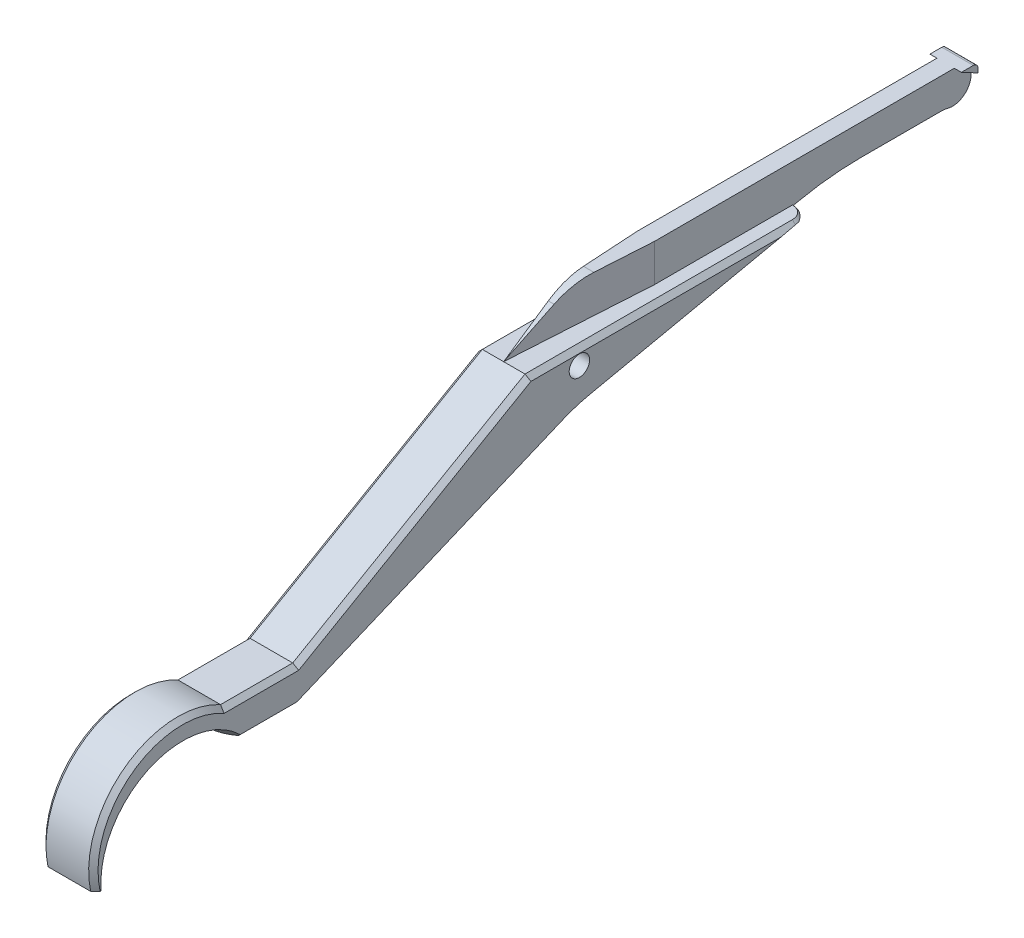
ISO-10303-21;
HEADER;
FILE_DESCRIPTION(('STEP AP214'),'2;1');
FILE_NAME('part.step','',(''),(''),'','','');
FILE_SCHEMA(('AUTOMOTIVE_DESIGN { 1 0 10303 214 1 1 1 1 }'));
ENDSEC;
DATA;
#1=APPLICATION_CONTEXT('core data for automotive mechanical design processes');
#2=APPLICATION_PROTOCOL_DEFINITION('international standard','automotive_design',2000,#1);
#3=PRODUCT_CONTEXT('',#1,'mechanical');
#4=PRODUCT('Part','Part','',(#3));
#5=PRODUCT_RELATED_PRODUCT_CATEGORY('part','',(#4));
#6=PRODUCT_DEFINITION_FORMATION('','',#4);
#7=PRODUCT_DEFINITION_CONTEXT('part definition',#1,'design');
#8=PRODUCT_DEFINITION('design','',#6,#7);
#9=PRODUCT_DEFINITION_SHAPE('','',#8);
#10=(LENGTH_UNIT() NAMED_UNIT(*) SI_UNIT(.MILLI.,.METRE.));
#11=(NAMED_UNIT(*) PLANE_ANGLE_UNIT() SI_UNIT($,.RADIAN.));
#12=(NAMED_UNIT(*) SI_UNIT($,.STERADIAN.) SOLID_ANGLE_UNIT());
#13=UNCERTAINTY_MEASURE_WITH_UNIT(LENGTH_MEASURE(1.E-05),#10,'distance_accuracy_value','');
#14=(GEOMETRIC_REPRESENTATION_CONTEXT(3) GLOBAL_UNCERTAINTY_ASSIGNED_CONTEXT((#13)) GLOBAL_UNIT_ASSIGNED_CONTEXT((#10,
#11,#12)) REPRESENTATION_CONTEXT('',''));
#15=CARTESIAN_POINT('',(0.,0.,0.));
#16=DIRECTION('',(0.,0.,1.));
#17=DIRECTION('',(1.,0.,0.));
#18=AXIS2_PLACEMENT_3D('',#15,#16,#17);
#19=CARTESIAN_POINT('',(4.4069,8.9408,-5.98019428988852));
#20=DIRECTION('',(0.,-1.,0.));
#21=DIRECTION('',(0.,0.,-1.));
#22=AXIS2_PLACEMENT_3D('',#19,#20,#21);
#23=PLANE('',#22);
#24=DIRECTION('',(-0.0610485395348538,0.,-0.998134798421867));
#25=VECTOR('',#24,1.);
#26=CARTESIAN_POINT('',(0.,8.9408,8.42128308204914));
#27=LINE('',#26,#25);
#28=CARTESIAN_POINT('',(-0.880832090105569,8.9408,-5.98019428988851));
#29=VERTEX_POINT('',#28);
#30=CARTESIAN_POINT('',(-1.4732,8.9408,-15.6653240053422));
#31=VERTEX_POINT('',#30);
#32=EDGE_CURVE('E284',#29,#31,#27,.T.);
#33=ORIENTED_EDGE('',*,*,#32,.F.);
#34=DIRECTION('',(-1.,0.,0.));
#35=VECTOR('',#34,1.);
#36=CARTESIAN_POINT('',(4.4069,8.9408,-5.98019428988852));
#37=LINE('',#36,#35);
#38=CARTESIAN_POINT('',(0.880832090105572,8.9408,-5.98019428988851));
#39=VERTEX_POINT('',#38);
#40=EDGE_CURVE('E589',#39,#29,#37,.T.);
#41=ORIENTED_EDGE('',*,*,#40,.F.);
#42=DIRECTION('',(-0.0610485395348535,0.,0.998134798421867));
#43=VECTOR('',#42,1.);
#44=CARTESIAN_POINT('',(1.47319999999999,8.9408,-15.6653240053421));
#45=LINE('',#44,#43);
#46=CARTESIAN_POINT('',(1.47319999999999,8.9408,-15.6653240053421));
#47=VERTEX_POINT('',#46);
#48=EDGE_CURVE('E296',#47,#39,#45,.T.);
#49=ORIENTED_EDGE('',*,*,#48,.F.);
#50=DIRECTION('',(0.,0.,-1.));
#51=VECTOR('',#50,1.);
#52=CARTESIAN_POINT('',(1.47319999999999,8.9408,-66.421943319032));
#53=LINE('',#52,#51);
#54=CARTESIAN_POINT('',(1.47319999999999,8.9408,-66.421943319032));
#55=VERTEX_POINT('',#54);
#56=EDGE_CURVE('E347',#47,#55,#53,.T.);
#57=ORIENTED_EDGE('',*,*,#56,.T.);
#58=DIRECTION('',(1.,0.,0.));
#59=VECTOR('',#58,1.);
#60=CARTESIAN_POINT('',(-77.9208541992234,8.9408,-66.421943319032));
#61=LINE('',#60,#59);
#62=CARTESIAN_POINT('',(2.66699999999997,8.9408,-66.421943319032));
#63=VERTEX_POINT('',#62);
#64=EDGE_CURVE('E345',#55,#63,#61,.T.);
#65=ORIENTED_EDGE('',*,*,#64,.T.);
#66=DIRECTION('',(0.,0.,1.));
#67=VECTOR('',#66,1.);
#68=CARTESIAN_POINT('',(2.66700000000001,8.9408,-69.2404));
#69=LINE('',#68,#67);
#70=CARTESIAN_POINT('',(2.66700000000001,8.9408,-68.44665));
#71=VERTEX_POINT('',#70);
#72=EDGE_CURVE('E730',#71,#63,#69,.T.);
#73=ORIENTED_EDGE('',*,*,#72,.F.);
#74=DIRECTION('',(-1.,0.,0.));
#75=VECTOR('',#74,1.);
#76=CARTESIAN_POINT('',(4.4069,8.9408,-68.44665));
#77=LINE('',#76,#75);
#78=CARTESIAN_POINT('',(-2.66700000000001,8.9408,-68.44665));
#79=VERTEX_POINT('',#78);
#80=EDGE_CURVE('E591',#71,#79,#77,.T.);
#81=ORIENTED_EDGE('',*,*,#80,.T.);
#82=DIRECTION('',(0.,0.,-1.));
#83=VECTOR('',#82,1.);
#84=CARTESIAN_POINT('',(-2.66700000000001,8.9408,-69.2404));
#85=LINE('',#84,#83);
#86=CARTESIAN_POINT('',(-2.66700000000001,8.9408,-66.421943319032));
#87=VERTEX_POINT('',#86);
#88=EDGE_CURVE('E737',#87,#79,#85,.T.);
#89=ORIENTED_EDGE('',*,*,#88,.F.);
#90=DIRECTION('',(-1.,0.,0.));
#91=VECTOR('',#90,1.);
#92=CARTESIAN_POINT('',(77.9208541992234,8.9408,-66.421943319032));
#93=LINE('',#92,#91);
#94=CARTESIAN_POINT('',(-1.47319999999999,8.9408,-66.421943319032));
#95=VERTEX_POINT('',#94);
#96=EDGE_CURVE('E310',#95,#87,#93,.T.);
#97=ORIENTED_EDGE('',*,*,#96,.F.);
#98=DIRECTION('',(0.,0.,1.));
#99=VECTOR('',#98,1.);
#100=CARTESIAN_POINT('',(-1.47319999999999,8.9408,-66.421943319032));
#101=LINE('',#100,#99);
#102=EDGE_CURVE('E301',#95,#31,#101,.T.);
#103=ORIENTED_EDGE('',*,*,#102,.T.);
#104=EDGE_LOOP('',(#33,#41,#49,#57,#65,#73,#81,#89,#97,#103));
#105=FACE_BOUND('',#104,.T.);
#106=ADVANCED_FACE('F37',(#105),#23,.F.);
#107=CARTESIAN_POINT('',(4.4069,-20.1168,47.752));
#108=DIRECTION('',(0.,-0.866025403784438,-0.500000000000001));
#109=DIRECTION('',(0.,0.500000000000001,-0.866025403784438));
#110=AXIS2_PLACEMENT_3D('',#107,#108,#109);
#111=PLANE('',#110);
#112=DIRECTION('',(-0.0528942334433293,0.49930006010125,-0.864813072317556));
#113=VECTOR('',#112,1.);
#114=CARTESIAN_POINT('',(2.41116902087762,-20.1696553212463,47.8435481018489));
#115=LINE('',#114,#113);
#116=CARTESIAN_POINT('',(0.,2.5908,8.42128308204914));
#117=VERTEX_POINT('',#116);
#118=CARTESIAN_POINT('',(-0.492449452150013,7.23932262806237,0.369805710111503));
#119=VERTEX_POINT('',#118);
#120=EDGE_CURVE('E723',#117,#119,#115,.T.);
#121=ORIENTED_EDGE('',*,*,#120,.F.);
#122=DIRECTION('',(-0.0528942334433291,-0.49930006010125,0.864813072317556));
#123=VECTOR('',#122,1.);
#124=CARTESIAN_POINT('',(-2.38650977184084,-19.936882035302,47.4403729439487));
#125=LINE('',#124,#123);
#126=CARTESIAN_POINT('',(0.492449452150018,7.23932262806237,0.369805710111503));
#127=VERTEX_POINT('',#126);
#128=EDGE_CURVE('E727',#127,#117,#125,.T.);
#129=ORIENTED_EDGE('',*,*,#128,.F.);
#130=DIRECTION('',(-1.,0.,0.));
#131=VECTOR('',#130,1.);
#132=CARTESIAN_POINT('',(4.4069,7.23932262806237,0.369805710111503));
#133=LINE('',#132,#131);
#134=EDGE_CURVE('E586',#127,#119,#133,.T.);
#135=ORIENTED_EDGE('',*,*,#134,.T.);
#136=EDGE_LOOP('',(#121,#129,#135));
#137=FACE_BOUND('',#136,.T.);
#138=ADVANCED_FACE('F539',(#137),#111,.F.);
#139=CARTESIAN_POINT('',(4.4069,-3.7592,-5.98019428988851));
#140=DIRECTION('',(-1.,0.,0.));
#141=DIRECTION('',(0.,0.,1.));
#142=AXIS2_PLACEMENT_3D('',#139,#140,#141);
#143=CYLINDRICAL_SURFACE('',#142,12.7);
#144=CARTESIAN_POINT('',(-0.88083209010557,-3.7592,-5.98019428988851));
#145=DIRECTION('',(-0.998134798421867,0.,0.0610485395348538));
#146=DIRECTION('',(-0.0610485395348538,0.,-0.998134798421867));
#147=AXIS2_PLACEMENT_3D('',#144,#145,#146);
#148=ELLIPSE('',#147,12.7237323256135,12.7);
#149=EDGE_CURVE('E291',#119,#29,#148,.T.);
#150=ORIENTED_EDGE('',*,*,#149,.F.);
#151=ORIENTED_EDGE('',*,*,#134,.F.);
#152=CARTESIAN_POINT('',(0.880832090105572,-3.7592,-5.98019428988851));
#153=DIRECTION('',(0.998134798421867,0.,0.0610485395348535));
#154=DIRECTION('',(-0.0610485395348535,0.,0.998134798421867));
#155=AXIS2_PLACEMENT_3D('',#152,#153,#154);
#156=ELLIPSE('',#155,12.7237323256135,12.7);
#157=EDGE_CURVE('E725',#39,#127,#156,.T.);
#158=ORIENTED_EDGE('',*,*,#157,.F.);
#159=ORIENTED_EDGE('',*,*,#40,.T.);
#160=EDGE_LOOP('',(#150,#151,#158,#159));
#161=FACE_BOUND('',#160,.T.);
#162=ADVANCED_FACE('F540',(#161),#143,.T.);
#163=CARTESIAN_POINT('',(1.4732,0.,0.));
#164=DIRECTION('',(1.,0.,0.));
#165=DIRECTION('',(0.,0.,-1.));
#166=AXIS2_PLACEMENT_3D('',#163,#164,#165);
#167=PLANE('',#166);
#168=ORIENTED_EDGE('',*,*,#56,.F.);
#169=DIRECTION('',(0.,-1.,0.));
#170=VECTOR('',#169,1.);
#171=CARTESIAN_POINT('',(1.47319999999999,8.9408,-15.6653240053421));
#172=LINE('',#171,#170);
#173=CARTESIAN_POINT('',(1.47319999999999,2.5908,-15.6653240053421));
#174=VERTEX_POINT('',#173);
#175=EDGE_CURVE('E305',#47,#174,#172,.T.);
#176=ORIENTED_EDGE('',*,*,#175,.T.);
#177=DIRECTION('',(0.,0.,1.));
#178=VECTOR('',#177,1.);
#179=CARTESIAN_POINT('',(1.47319999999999,2.5908,8.42128308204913));
#180=LINE('',#179,#178);
#181=CARTESIAN_POINT('',(1.47319999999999,2.5908,-39.005363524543));
#182=VERTEX_POINT('',#181);
#183=EDGE_CURVE('E349',#182,#174,#180,.T.);
#184=ORIENTED_EDGE('',*,*,#183,.F.);
#185=DIRECTION('',(0.,0.707106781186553,0.707106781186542));
#186=VECTOR('',#185,1.);
#187=CARTESIAN_POINT('',(1.4732,4.73075000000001,-36.865413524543));
#188=LINE('',#187,#186);
#189=CARTESIAN_POINT('',(1.4732,2.45165863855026,-39.1445048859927));
#190=VERTEX_POINT('',#189);
#191=EDGE_CURVE('E695',#182,#190,#188,.F.);
#192=ORIENTED_EDGE('',*,*,#191,.T.);
#193=DIRECTION('',(0.,0.207911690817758,-0.978147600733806));
#194=VECTOR('',#193,1.);
#195=CARTESIAN_POINT('',(1.4732,-5.47281384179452,-1.86279305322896));
#196=LINE('',#195,#194);
#197=CARTESIAN_POINT('',(1.4732,2.64909811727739,-40.073384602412));
#198=VERTEX_POINT('',#197);
#199=EDGE_CURVE('E366',#190,#198,#196,.T.);
#200=ORIENTED_EDGE('',*,*,#199,.T.);
#201=CARTESIAN_POINT('',(1.4732,-47.0408,-50.6352984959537));
#202=DIRECTION('',(1.,0.,0.));
#203=DIRECTION('',(0.,0.,-1.));
#204=AXIS2_PLACEMENT_3D('',#201,#202,#203);
#205=CIRCLE('',#204,50.8);
#206=CARTESIAN_POINT('',(1.4732,3.7592,-50.6352984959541));
#207=VERTEX_POINT('',#206);
#208=EDGE_CURVE('E364',#198,#207,#205,.F.);
#209=ORIENTED_EDGE('',*,*,#208,.T.);
#210=DIRECTION('',(0.,0.,-1.));
#211=VECTOR('',#210,1.);
#212=CARTESIAN_POINT('',(1.4732,3.7592,-50.6352984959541));
#213=LINE('',#212,#211);
#214=CARTESIAN_POINT('',(1.4732,3.75919999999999,-64.3243613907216));
#215=VERTEX_POINT('',#214);
#216=EDGE_CURVE('E362',#207,#215,#213,.T.);
#217=ORIENTED_EDGE('',*,*,#216,.T.);
#218=CARTESIAN_POINT('',(1.4732,0.5842,-64.3243613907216));
#219=DIRECTION('',(1.,0.,0.));
#220=DIRECTION('',(0.,0.,-1.));
#221=AXIS2_PLACEMENT_3D('',#218,#219,#220);
#222=CIRCLE('',#221,3.17499999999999);
#223=CARTESIAN_POINT('',(1.4732,3.63219999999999,-65.2133613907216));
#224=VERTEX_POINT('',#223);
#225=EDGE_CURVE('E360',#215,#224,#222,.F.);
#226=ORIENTED_EDGE('',*,*,#225,.T.);
#227=CARTESIAN_POINT('',(1.4732,6.6802,-66.1023613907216));
#228=DIRECTION('',(1.,0.,0.));
#229=DIRECTION('',(0.,0.,-1.));
#230=AXIS2_PLACEMENT_3D('',#227,#228,#229);
#231=CIRCLE('',#230,3.175);
#232=CARTESIAN_POINT('',(1.47319999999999,6.19714856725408,-69.2404));
#233=VERTEX_POINT('',#232);
#234=EDGE_CURVE('E358',#224,#233,#231,.T.);
#235=ORIENTED_EDGE('',*,*,#234,.T.);
#236=DIRECTION('',(0.,-1.,0.));
#237=VECTOR('',#236,1.);
#238=CARTESIAN_POINT('',(1.47319999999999,2.5908,-69.2404));
#239=LINE('',#238,#237);
#240=CARTESIAN_POINT('',(1.47319999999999,7.4422,-69.2404));
#241=VERTEX_POINT('',#240);
#242=EDGE_CURVE('E341',#241,#233,#239,.T.);
#243=ORIENTED_EDGE('',*,*,#242,.F.);
#244=DIRECTION('',(0.,-0.469471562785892,-0.882947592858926));
#245=VECTOR('',#244,1.);
#246=CARTESIAN_POINT('',(1.47319999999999,7.4422,-69.2404));
#247=LINE('',#246,#245);
#248=EDGE_CURVE('E344',#55,#241,#247,.T.);
#249=ORIENTED_EDGE('',*,*,#248,.F.);
#250=EDGE_LOOP('',(#168,#176,#184,#192,#200,#209,#217,#226,#235,#243,#249));
#251=FACE_BOUND('',#250,.T.);
#252=ADVANCED_FACE('F543',(#251),#167,.T.);
#253=CARTESIAN_POINT('',(-1.4732,0.,0.));
#254=DIRECTION('',(1.,0.,0.));
#255=DIRECTION('',(0.,0.,-1.));
#256=AXIS2_PLACEMENT_3D('',#253,#254,#255);
#257=PLANE('',#256);
#258=DIRECTION('',(0.,-1.,0.));
#259=VECTOR('',#258,1.);
#260=CARTESIAN_POINT('',(-1.4732,8.9408,-15.6653240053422));
#261=LINE('',#260,#259);
#262=CARTESIAN_POINT('',(-1.47319999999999,2.5908,-15.6653240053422));
#263=VERTEX_POINT('',#262);
#264=EDGE_CURVE('E288',#31,#263,#261,.T.);
#265=ORIENTED_EDGE('',*,*,#264,.F.);
#266=ORIENTED_EDGE('',*,*,#102,.F.);
#267=DIRECTION('',(0.,0.469471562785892,0.882947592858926));
#268=VECTOR('',#267,1.);
#269=CARTESIAN_POINT('',(-1.47319999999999,7.4422,-69.2404));
#270=LINE('',#269,#268);
#271=CARTESIAN_POINT('',(-1.47319999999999,7.4422,-69.2404));
#272=VERTEX_POINT('',#271);
#273=EDGE_CURVE('E328',#272,#95,#270,.T.);
#274=ORIENTED_EDGE('',*,*,#273,.F.);
#275=DIRECTION('',(0.,1.,0.));
#276=VECTOR('',#275,1.);
#277=CARTESIAN_POINT('',(-1.47319999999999,2.5908,-69.2404));
#278=LINE('',#277,#276);
#279=CARTESIAN_POINT('',(-1.47319999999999,6.19714856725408,-69.2404));
#280=VERTEX_POINT('',#279);
#281=EDGE_CURVE('E312',#280,#272,#278,.T.);
#282=ORIENTED_EDGE('',*,*,#281,.F.);
#283=CARTESIAN_POINT('',(-1.4732,6.6802,-66.1023613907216));
#284=DIRECTION('',(1.,0.,0.));
#285=DIRECTION('',(0.,0.,-1.));
#286=AXIS2_PLACEMENT_3D('',#283,#284,#285);
#287=CIRCLE('',#286,3.175);
#288=CARTESIAN_POINT('',(-1.4732,3.63219999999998,-65.2133613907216));
#289=VERTEX_POINT('',#288);
#290=EDGE_CURVE('E337',#289,#280,#287,.T.);
#291=ORIENTED_EDGE('',*,*,#290,.F.);
#292=CARTESIAN_POINT('',(-1.4732,0.5842,-64.3243613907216));
#293=DIRECTION('',(1.,0.,0.));
#294=DIRECTION('',(0.,0.,-1.));
#295=AXIS2_PLACEMENT_3D('',#292,#293,#294);
#296=CIRCLE('',#295,3.17499999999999);
#297=CARTESIAN_POINT('',(-1.4732,3.75919999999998,-64.3243613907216));
#298=VERTEX_POINT('',#297);
#299=EDGE_CURVE('E334',#298,#289,#296,.F.);
#300=ORIENTED_EDGE('',*,*,#299,.F.);
#301=DIRECTION('',(0.,0.,-1.));
#302=VECTOR('',#301,1.);
#303=CARTESIAN_POINT('',(-1.4732,3.7592,-50.6352984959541));
#304=LINE('',#303,#302);
#305=CARTESIAN_POINT('',(-1.4732,3.75919999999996,-50.6352984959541));
#306=VERTEX_POINT('',#305);
#307=EDGE_CURVE('E331',#306,#298,#304,.T.);
#308=ORIENTED_EDGE('',*,*,#307,.F.);
#309=CARTESIAN_POINT('',(-1.4732,-47.0408,-50.6352984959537));
#310=DIRECTION('',(1.,0.,0.));
#311=DIRECTION('',(0.,0.,-1.));
#312=AXIS2_PLACEMENT_3D('',#309,#310,#311);
#313=CIRCLE('',#312,50.8);
#314=CARTESIAN_POINT('',(-1.4732,2.64909811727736,-40.073384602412));
#315=VERTEX_POINT('',#314);
#316=EDGE_CURVE('E327',#315,#306,#313,.F.);
#317=ORIENTED_EDGE('',*,*,#316,.F.);
#318=DIRECTION('',(0.,0.207911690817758,-0.978147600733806));
#319=VECTOR('',#318,1.);
#320=CARTESIAN_POINT('',(-1.4732,-5.47281384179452,-1.86279305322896));
#321=LINE('',#320,#319);
#322=CARTESIAN_POINT('',(-1.4732,2.45165863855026,-39.1445048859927));
#323=VERTEX_POINT('',#322);
#324=EDGE_CURVE('E324',#323,#315,#321,.T.);
#325=ORIENTED_EDGE('',*,*,#324,.F.);
#326=DIRECTION('',(0.,0.707106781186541,0.707106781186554));
#327=VECTOR('',#326,1.);
#328=CARTESIAN_POINT('',(-1.4732,4.73074999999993,-36.865413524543));
#329=LINE('',#328,#327);
#330=CARTESIAN_POINT('',(-1.47319999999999,2.5908,-39.005363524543));
#331=VERTEX_POINT('',#330);
#332=EDGE_CURVE('E693',#323,#331,#329,.T.);
#333=ORIENTED_EDGE('',*,*,#332,.T.);
#334=DIRECTION('',(0.,0.,-1.));
#335=VECTOR('',#334,1.);
#336=CARTESIAN_POINT('',(-1.47319999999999,2.5908,8.42128308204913));
#337=LINE('',#336,#335);
#338=EDGE_CURVE('E304',#263,#331,#337,.T.);
#339=ORIENTED_EDGE('',*,*,#338,.F.);
#340=EDGE_LOOP('',(#265,#266,#274,#282,#291,#300,#308,#317,#325,#333,#339));
#341=FACE_BOUND('',#340,.T.);
#342=ADVANCED_FACE('F300',(#341),#257,.F.);
#343=CARTESIAN_POINT('',(-4.4069,-33.3375,67.2257231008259));
#344=DIRECTION('',(1.,0.,0.));
#345=DIRECTION('',(0.,0.,-1.));
#346=AXIS2_PLACEMENT_3D('',#343,#344,#345);
#347=PLANE('',#346);
#348=CARTESIAN_POINT('',(-4.4069,0.,0.));
#349=DIRECTION('',(1.,0.,0.));
#350=DIRECTION('',(0.,0.,-1.));
#351=AXIS2_PLACEMENT_3D('',#348,#349,#350);
#352=CIRCLE('',#351,1.7272);
#353=CARTESIAN_POINT('',(-4.4069,0.,-1.7272));
#354=VERTEX_POINT('',#353);
#355=EDGE_CURVE('E569',#354,#354,#352,.T.);
#356=ORIENTED_EDGE('',*,*,#355,.T.);
#357=EDGE_LOOP('',(#356));
#358=FACE_BOUND('',#357,.T.);
#359=DIRECTION('',(0.,0.,-1.));
#360=VECTOR('',#359,1.);
#361=CARTESIAN_POINT('',(-4.4069,1.79704999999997,-36.865413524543));
#362=LINE('',#361,#360);
#363=CARTESIAN_POINT('',(-4.4069,1.79704999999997,8.2085984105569));
#364=VERTEX_POINT('',#363);
#365=CARTESIAN_POINT('',(-4.4069,1.79704999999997,-34.1559500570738));
#366=VERTEX_POINT('',#365);
#367=EDGE_CURVE('E479',#364,#366,#362,.T.);
#368=ORIENTED_EDGE('',*,*,#367,.T.);
#369=DIRECTION('',(0.,-0.207911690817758,0.978147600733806));
#370=VECTOR('',#369,1.);
#371=CARTESIAN_POINT('',(-4.4069,-20.3395414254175,69.9885244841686));
#372=LINE('',#371,#370);
#373=CARTESIAN_POINT('',(-4.4069,-5.08461151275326,-1.78027810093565));
#374=VERTEX_POINT('',#373);
#375=EDGE_CURVE('E12',#366,#374,#372,.T.);
#376=ORIENTED_EDGE('',*,*,#375,.T.);
#377=CARTESIAN_POINT('',(-4.4069,-30.3177629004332,-7.14375));
#378=DIRECTION('',(1.,0.,0.));
#379=DIRECTION('',(0.,0.,-1.));
#380=AXIS2_PLACEMENT_3D('',#377,#378,#379);
#381=CIRCLE('',#380,25.796875);
#382=CARTESIAN_POINT('',(-4.4069,-6.52528956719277,2.82605302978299));
#383=VERTEX_POINT('',#382);
#384=EDGE_CURVE('E47',#374,#383,#381,.T.);
#385=ORIENTED_EDGE('',*,*,#384,.T.);
#386=DIRECTION('',(0.,-0.386473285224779,0.92230060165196));
#387=VECTOR('',#386,1.);
#388=CARTESIAN_POINT('',(-4.4069,-33.484915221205,67.1639514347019));
#389=LINE('',#388,#387);
#390=CARTESIAN_POINT('',(-4.4069,-25.384125,47.8317906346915));
#391=VERTEX_POINT('',#390);
#392=EDGE_CURVE('E1212',#383,#391,#389,.T.);
#393=ORIENTED_EDGE('',*,*,#392,.T.);
#394=DIRECTION('',(0.,0.,1.));
#395=VECTOR('',#394,1.);
#396=CARTESIAN_POINT('',(-4.4069,-25.384125,67.2257231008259));
#397=LINE('',#396,#395);
#398=CARTESIAN_POINT('',(-4.4069,-25.384125,57.4345621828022));
#399=VERTEX_POINT('',#398);
#400=EDGE_CURVE('E774',#391,#399,#397,.T.);
#401=ORIENTED_EDGE('',*,*,#400,.T.);
#402=CARTESIAN_POINT('',(-4.4069,-35.321875,67.1373337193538));
#403=DIRECTION('',(1.,0.,0.));
#404=DIRECTION('',(0.,0.,-1.));
#405=AXIS2_PLACEMENT_3D('',#402,#403,#404);
#406=CIRCLE('',#405,13.8889398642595);
#407=CARTESIAN_POINT('',(-4.4069,-36.5125,80.9751465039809));
#408=VERTEX_POINT('',#407);
#409=EDGE_CURVE('E575',#399,#408,#406,.T.);
#410=ORIENTED_EDGE('',*,*,#409,.T.);
#411=DIRECTION('',(0.,0.,-1.));
#412=VECTOR('',#411,1.);
#413=CARTESIAN_POINT('',(-4.4069,-36.5125,81.968975));
#414=LINE('',#413,#412);
#415=CARTESIAN_POINT('',(-4.4069,-36.5125,81.1559790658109));
#416=VERTEX_POINT('',#415);
#417=EDGE_CURVE('E568',#416,#408,#414,.T.);
#418=ORIENTED_EDGE('',*,*,#417,.F.);
#419=CARTESIAN_POINT('',(-4.4069,-33.3375,67.2257231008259));
#420=DIRECTION('',(1.,0.,0.));
#421=DIRECTION('',(0.,0.,-1.));
#422=AXIS2_PLACEMENT_3D('',#419,#420,#421);
#423=CIRCLE('',#422,14.2875);
#424=CARTESIAN_POINT('',(-4.4069,-20.91055,60.1756472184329));
#425=VERTEX_POINT('',#424);
#426=EDGE_CURVE('E670',#416,#425,#423,.F.);
#427=ORIENTED_EDGE('',*,*,#426,.T.);
#428=DIRECTION('',(0.,0.,-1.));
#429=VECTOR('',#428,1.);
#430=CARTESIAN_POINT('',(-4.4069,-20.91055,67.2257231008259));
#431=LINE('',#430,#429);
#432=CARTESIAN_POINT('',(-4.4069,-20.91055,47.5393153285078));
#433=VERTEX_POINT('',#432);
#434=EDGE_CURVE('E674',#425,#433,#431,.T.);
#435=ORIENTED_EDGE('',*,*,#434,.T.);
#436=DIRECTION('',(0.,0.500000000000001,-0.866025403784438));
#437=VECTOR('',#436,1.);
#438=CARTESIAN_POINT('',(-4.4069,-32.5417521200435,67.6851483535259));
#439=LINE('',#438,#437);
#440=EDGE_CURVE('E769',#433,#364,#439,.T.);
#441=ORIENTED_EDGE('',*,*,#440,.T.);
#442=EDGE_LOOP('',(#368,#376,#385,#393,#401,#410,#418,#427,#435,#441));
#443=FACE_BOUND('',#442,.T.);
#444=ADVANCED_FACE('F510',(#358,#443),#347,.F.);
#445=CARTESIAN_POINT('',(4.4069,-5.47281384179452,-1.86279305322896));
#446=DIRECTION('',(0.,0.978147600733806,0.207911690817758));
#447=DIRECTION('',(0.,-0.207911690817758,0.978147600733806));
#448=AXIS2_PLACEMENT_3D('',#445,#446,#447);
#449=PLANE('',#448);
#450=CARTESIAN_POINT('',(1.47319999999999,1.83645785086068,-36.2502127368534));
#451=DIRECTION('',(0.,0.978147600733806,0.207911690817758));
#452=DIRECTION('',(0.,-0.207911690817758,0.978147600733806));
#453=AXIS2_PLACEMENT_3D('',#450,#451,#452);
#454=ELLIPSE('',#453,2.95895235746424,2.8281539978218);
#455=CARTESIAN_POINT('',(4.010025,2.108408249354,-37.5296387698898));
#456=VERTEX_POINT('',#455);
#457=EDGE_CURVE('E631',#190,#456,#454,.F.);
#458=ORIENTED_EDGE('',*,*,#457,.T.);
#459=DIRECTION('',(0.,-0.207911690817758,0.978147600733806));
#460=VECTOR('',#459,1.);
#461=CARTESIAN_POINT('',(4.01002499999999,-5.47281384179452,-1.86279305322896));
#462=LINE('',#461,#460);
#463=CARTESIAN_POINT('',(4.01002499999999,-5.47281384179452,-1.86279305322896));
#464=VERTEX_POINT('',#463);
#465=EDGE_CURVE('E1169',#456,#464,#462,.T.);
#466=ORIENTED_EDGE('',*,*,#465,.T.);
#467=DIRECTION('',(-1.,0.,0.));
#468=VECTOR('',#467,1.);
#469=CARTESIAN_POINT('',(4.4069,-5.47281384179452,-1.86279305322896));
#470=LINE('',#469,#468);
#471=CARTESIAN_POINT('',(-4.01002499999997,-5.47281384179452,-1.86279305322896));
#472=VERTEX_POINT('',#471);
#473=EDGE_CURVE('E610',#464,#472,#470,.T.);
#474=ORIENTED_EDGE('',*,*,#473,.T.);
#475=DIRECTION('',(0.,0.207911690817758,-0.978147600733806));
#476=VECTOR('',#475,1.);
#477=CARTESIAN_POINT('',(-4.01002499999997,-5.47281384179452,-1.86279305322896));
#478=LINE('',#477,#476);
#479=CARTESIAN_POINT('',(-4.01002499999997,2.10840824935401,-37.5296387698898));
#480=VERTEX_POINT('',#479);
#481=EDGE_CURVE('E761',#472,#480,#478,.T.);
#482=ORIENTED_EDGE('',*,*,#481,.T.);
#483=CARTESIAN_POINT('',(-1.47319999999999,1.83645785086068,-36.2502127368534));
#484=DIRECTION('',(0.,0.978147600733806,0.207911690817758));
#485=DIRECTION('',(0.,-0.207911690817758,0.978147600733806));
#486=AXIS2_PLACEMENT_3D('',#483,#484,#485);
#487=ELLIPSE('',#486,2.95895235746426,2.82815399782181);
#488=EDGE_CURVE('E636',#480,#323,#487,.F.);
#489=ORIENTED_EDGE('',*,*,#488,.T.);
#490=ORIENTED_EDGE('',*,*,#324,.T.);
#491=DIRECTION('',(-1.,0.,0.));
#492=VECTOR('',#491,1.);
#493=CARTESIAN_POINT('',(4.4069,2.64909811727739,-40.073384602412));
#494=LINE('',#493,#492);
#495=EDGE_CURVE('E607',#198,#315,#494,.T.);
#496=ORIENTED_EDGE('',*,*,#495,.F.);
#497=ORIENTED_EDGE('',*,*,#199,.F.);
#498=EDGE_LOOP('',(#458,#466,#474,#482,#489,#490,#496,#497));
#499=FACE_BOUND('',#498,.T.);
#500=ADVANCED_FACE('F506',(#499),#449,.F.);
#501=CARTESIAN_POINT('',(4.4069,8.14704999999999,-69.2404));
#502=DIRECTION('',(0.,0.,1.));
#503=DIRECTION('',(1.,0.,0.));
#504=AXIS2_PLACEMENT_3D('',#501,#502,#503);
#505=PLANE('',#504);
#506=DIRECTION('',(-1.,0.,0.));
#507=VECTOR('',#506,1.);
#508=CARTESIAN_POINT('',(4.4069,8.14704999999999,-69.2404));
#509=LINE('',#508,#507);
#510=CARTESIAN_POINT('',(2.66700000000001,8.14705,-69.2404));
#511=VERTEX_POINT('',#510);
#512=CARTESIAN_POINT('',(-2.66700000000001,8.14705,-69.2404));
#513=VERTEX_POINT('',#512);
#514=EDGE_CURVE('E593',#511,#513,#509,.T.);
#515=ORIENTED_EDGE('',*,*,#514,.F.);
#516=DIRECTION('',(0.,1.,0.));
#517=VECTOR('',#516,1.);
#518=CARTESIAN_POINT('',(2.66700000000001,-37.0896854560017,-69.2404));
#519=LINE('',#518,#517);
#520=CARTESIAN_POINT('',(2.66700000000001,7.4422,-69.2404));
#521=VERTEX_POINT('',#520);
#522=EDGE_CURVE('E732',#521,#511,#519,.T.);
#523=ORIENTED_EDGE('',*,*,#522,.F.);
#524=DIRECTION('',(1.,0.,0.));
#525=VECTOR('',#524,1.);
#526=CARTESIAN_POINT('',(-77.9208541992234,7.4422,-69.2404));
#527=LINE('',#526,#525);
#528=EDGE_CURVE('E352',#241,#521,#527,.T.);
#529=ORIENTED_EDGE('',*,*,#528,.F.);
#530=ORIENTED_EDGE('',*,*,#242,.T.);
#531=DIRECTION('',(-1.,0.,0.));
#532=VECTOR('',#531,1.);
#533=CARTESIAN_POINT('',(4.4069,6.19714856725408,-69.2404));
#534=LINE('',#533,#532);
#535=EDGE_CURVE('E595',#233,#280,#534,.T.);
#536=ORIENTED_EDGE('',*,*,#535,.T.);
#537=ORIENTED_EDGE('',*,*,#281,.T.);
#538=DIRECTION('',(-1.,0.,0.));
#539=VECTOR('',#538,1.);
#540=CARTESIAN_POINT('',(77.9208541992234,7.4422,-69.2404));
#541=LINE('',#540,#539);
#542=CARTESIAN_POINT('',(-2.667,7.4422,-69.2404));
#543=VERTEX_POINT('',#542);
#544=EDGE_CURVE('E314',#272,#543,#541,.T.);
#545=ORIENTED_EDGE('',*,*,#544,.T.);
#546=DIRECTION('',(0.,1.,0.));
#547=VECTOR('',#546,1.);
#548=CARTESIAN_POINT('',(-2.66700000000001,-37.0896854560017,-69.2404));
#549=LINE('',#548,#547);
#550=EDGE_CURVE('E739',#543,#513,#549,.T.);
#551=ORIENTED_EDGE('',*,*,#550,.T.);
#552=EDGE_LOOP('',(#515,#523,#529,#530,#536,#537,#545,#551));
#553=FACE_BOUND('',#552,.T.);
#554=ADVANCED_FACE('F509',(#553),#505,.F.);
#555=DIRECTION('',(-1.,0.,0.));
#556=VECTOR('',#555,1.);
#557=CARTESIAN_POINT('',(77.9208541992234,2.5908,8.42128308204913));
#558=LINE('',#557,#556);
#559=CARTESIAN_POINT('',(-3.61314999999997,2.5908,8.42128308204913));
#560=VERTEX_POINT('',#559);
#561=EDGE_CURVE('E318',#117,#560,#558,.T.);
#562=ORIENTED_EDGE('',*,*,#561,.T.);
#563=DIRECTION('',(0.,-0.500000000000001,0.866025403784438));
#564=VECTOR('',#563,1.);
#565=CARTESIAN_POINT('',(-3.61314999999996,-20.1168,47.752));
#566=LINE('',#565,#564);
#567=CARTESIAN_POINT('',(-3.61314999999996,-20.1168,47.752));
#568=VERTEX_POINT('',#567);
#569=EDGE_CURVE('E679',#560,#568,#566,.T.);
#570=ORIENTED_EDGE('',*,*,#569,.T.);
#571=DIRECTION('',(-1.,0.,0.));
#572=VECTOR('',#571,1.);
#573=CARTESIAN_POINT('',(4.4069,-20.1168,47.752));
#574=LINE('',#573,#572);
#575=CARTESIAN_POINT('',(3.61314999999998,-20.1168,47.752));
#576=VERTEX_POINT('',#575);
#577=EDGE_CURVE('E583',#576,#568,#574,.T.);
#578=ORIENTED_EDGE('',*,*,#577,.F.);
#579=DIRECTION('',(0.,0.500000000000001,-0.866025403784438));
#580=VECTOR('',#579,1.);
#581=CARTESIAN_POINT('',(3.61314999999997,2.59079999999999,8.42128308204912));
#582=LINE('',#581,#580);
#583=CARTESIAN_POINT('',(3.61314999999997,2.5908,8.42128308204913));
#584=VERTEX_POINT('',#583);
#585=EDGE_CURVE('E672',#576,#584,#582,.T.);
#586=ORIENTED_EDGE('',*,*,#585,.T.);
#587=DIRECTION('',(1.,0.,0.));
#588=VECTOR('',#587,1.);
#589=CARTESIAN_POINT('',(-77.9208541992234,2.5908,8.42128308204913));
#590=LINE('',#589,#588);
#591=EDGE_CURVE('E340',#117,#584,#590,.T.);
#592=ORIENTED_EDGE('',*,*,#591,.F.);
#593=EDGE_LOOP('',(#562,#570,#578,#586,#592));
#594=FACE_BOUND('',#593,.T.);
#595=ADVANCED_FACE('F516',(#594),#111,.F.);
#596=CARTESIAN_POINT('',(4.4069,-47.0408,-50.6352984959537));
#597=DIRECTION('',(-1.,0.,0.));
#598=DIRECTION('',(0.,0.,1.));
#599=AXIS2_PLACEMENT_3D('',#596,#597,#598);
#600=CYLINDRICAL_SURFACE('',#599,50.8);
#601=ORIENTED_EDGE('',*,*,#495,.T.);
#602=ORIENTED_EDGE('',*,*,#316,.T.);
#603=DIRECTION('',(-1.,0.,0.));
#604=VECTOR('',#603,1.);
#605=CARTESIAN_POINT('',(4.4069,3.7592,-50.6352984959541));
#606=LINE('',#605,#604);
#607=EDGE_CURVE('E604',#207,#306,#606,.T.);
#608=ORIENTED_EDGE('',*,*,#607,.F.);
#609=ORIENTED_EDGE('',*,*,#208,.F.);
#610=EDGE_LOOP('',(#601,#602,#608,#609));
#611=FACE_BOUND('',#610,.T.);
#612=ADVANCED_FACE('F512',(#611),#600,.F.);
#613=CARTESIAN_POINT('',(4.4069,3.7592,-50.6352984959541));
#614=DIRECTION('',(0.,1.,0.));
#615=DIRECTION('',(0.,0.,1.));
#616=AXIS2_PLACEMENT_3D('',#613,#614,#615);
#617=PLANE('',#616);
#618=ORIENTED_EDGE('',*,*,#607,.T.);
#619=ORIENTED_EDGE('',*,*,#307,.T.);
#620=DIRECTION('',(-1.,0.,0.));
#621=VECTOR('',#620,1.);
#622=CARTESIAN_POINT('',(4.4069,3.75919999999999,-64.3243613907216));
#623=LINE('',#622,#621);
#624=EDGE_CURVE('E601',#215,#298,#623,.T.);
#625=ORIENTED_EDGE('',*,*,#624,.F.);
#626=ORIENTED_EDGE('',*,*,#216,.F.);
#627=EDGE_LOOP('',(#618,#619,#625,#626));
#628=FACE_BOUND('',#627,.T.);
#629=ADVANCED_FACE('F515',(#628),#617,.F.);
#630=CARTESIAN_POINT('',(4.4069,0.5842,-64.3243613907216));
#631=DIRECTION('',(-1.,0.,0.));
#632=DIRECTION('',(0.,0.,1.));
#633=AXIS2_PLACEMENT_3D('',#630,#631,#632);
#634=CYLINDRICAL_SURFACE('',#633,3.17499999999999);
#635=ORIENTED_EDGE('',*,*,#624,.T.);
#636=ORIENTED_EDGE('',*,*,#299,.T.);
#637=DIRECTION('',(-1.,0.,0.));
#638=VECTOR('',#637,1.);
#639=CARTESIAN_POINT('',(4.4069,3.63219999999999,-65.2133613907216));
#640=LINE('',#639,#638);
#641=EDGE_CURVE('E598',#224,#289,#640,.T.);
#642=ORIENTED_EDGE('',*,*,#641,.F.);
#643=ORIENTED_EDGE('',*,*,#225,.F.);
#644=EDGE_LOOP('',(#635,#636,#642,#643));
#645=FACE_BOUND('',#644,.T.);
#646=ADVANCED_FACE('F520',(#645),#634,.F.);
#647=CARTESIAN_POINT('',(4.4069,6.6802,-66.1023613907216));
#648=DIRECTION('',(-1.,0.,0.));
#649=DIRECTION('',(0.,0.,1.));
#650=AXIS2_PLACEMENT_3D('',#647,#648,#649);
#651=CYLINDRICAL_SURFACE('',#650,3.175);
#652=ORIENTED_EDGE('',*,*,#641,.T.);
#653=ORIENTED_EDGE('',*,*,#290,.T.);
#654=ORIENTED_EDGE('',*,*,#535,.F.);
#655=ORIENTED_EDGE('',*,*,#234,.F.);
#656=EDGE_LOOP('',(#652,#653,#654,#655));
#657=FACE_BOUND('',#656,.T.);
#658=ADVANCED_FACE('F524',(#657),#651,.T.);
#659=CARTESIAN_POINT('',(4.4069,-33.3375,67.2257231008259));
#660=DIRECTION('',(1.,0.,0.));
#661=DIRECTION('',(0.,0.,-1.));
#662=AXIS2_PLACEMENT_3D('',#659,#660,#661);
#663=PLANE('',#662);
#664=CARTESIAN_POINT('',(4.4069,-30.3177629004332,-7.14375));
#665=DIRECTION('',(1.,0.,0.));
#666=DIRECTION('',(0.,0.,-1.));
#667=AXIS2_PLACEMENT_3D('',#664,#665,#666);
#668=CIRCLE('',#667,25.796875);
#669=CARTESIAN_POINT('',(4.4069,-6.5252895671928,2.82605302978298));
#670=VERTEX_POINT('',#669);
#671=CARTESIAN_POINT('',(4.4069,-5.0846115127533,-1.78027810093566));
#672=VERTEX_POINT('',#671);
#673=EDGE_CURVE('E562',#670,#672,#668,.F.);
#674=ORIENTED_EDGE('',*,*,#673,.T.);
#675=DIRECTION('',(0.,0.207911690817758,-0.978147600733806));
#676=VECTOR('',#675,1.);
#677=CARTESIAN_POINT('',(4.4069,2.18525232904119,-35.982298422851));
#678=LINE('',#677,#676);
#679=CARTESIAN_POINT('',(4.4069,1.79704999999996,-34.1559500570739));
#680=VERTEX_POINT('',#679);
#681=EDGE_CURVE('E1187',#672,#680,#678,.T.);
#682=ORIENTED_EDGE('',*,*,#681,.T.);
#683=DIRECTION('',(0.,0.,1.));
#684=VECTOR('',#683,1.);
#685=CARTESIAN_POINT('',(4.4069,1.79704999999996,8.42128308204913));
#686=LINE('',#685,#684);
#687=CARTESIAN_POINT('',(4.4069,1.79704999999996,8.20859841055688));
#688=VERTEX_POINT('',#687);
#689=EDGE_CURVE('E686',#680,#688,#686,.T.);
#690=ORIENTED_EDGE('',*,*,#689,.T.);
#691=DIRECTION('',(0.,-0.500000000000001,0.866025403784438));
#692=VECTOR('',#691,1.);
#693=CARTESIAN_POINT('',(4.4069,-20.8042076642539,47.355125));
#694=LINE('',#693,#692);
#695=CARTESIAN_POINT('',(4.4069,-20.91055,47.5393153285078));
#696=VERTEX_POINT('',#695);
#697=EDGE_CURVE('E688',#688,#696,#694,.T.);
#698=ORIENTED_EDGE('',*,*,#697,.T.);
#699=DIRECTION('',(0.,0.,1.));
#700=VECTOR('',#699,1.);
#701=CARTESIAN_POINT('',(4.4069,-20.91055,59.9691954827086));
#702=LINE('',#701,#700);
#703=CARTESIAN_POINT('',(4.4069,-20.91055,60.1756472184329));
#704=VERTEX_POINT('',#703);
#705=EDGE_CURVE('E690',#696,#704,#702,.T.);
#706=ORIENTED_EDGE('',*,*,#705,.T.);
#707=CARTESIAN_POINT('',(4.4069,-33.3375,67.2257231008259));
#708=DIRECTION('',(1.,0.,0.));
#709=DIRECTION('',(0.,0.,-1.));
#710=AXIS2_PLACEMENT_3D('',#707,#708,#709);
#711=CIRCLE('',#710,14.2875);
#712=CARTESIAN_POINT('',(4.4069,-36.5125,81.1559790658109));
#713=VERTEX_POINT('',#712);
#714=EDGE_CURVE('E657',#704,#713,#711,.T.);
#715=ORIENTED_EDGE('',*,*,#714,.T.);
#716=DIRECTION('',(0.,0.,-1.));
#717=VECTOR('',#716,1.);
#718=CARTESIAN_POINT('',(4.4069,-36.5125,81.968975));
#719=LINE('',#718,#717);
#720=CARTESIAN_POINT('',(4.4069,-36.5125,80.9751465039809));
#721=VERTEX_POINT('',#720);
#722=EDGE_CURVE('E572',#713,#721,#719,.T.);
#723=ORIENTED_EDGE('',*,*,#722,.T.);
#724=CARTESIAN_POINT('',(4.4069,-35.321875,67.1373337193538));
#725=DIRECTION('',(1.,0.,0.));
#726=DIRECTION('',(0.,0.,-1.));
#727=AXIS2_PLACEMENT_3D('',#724,#725,#726);
#728=CIRCLE('',#727,13.8889398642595);
#729=CARTESIAN_POINT('',(4.4069,-25.384125,57.4345621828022));
#730=VERTEX_POINT('',#729);
#731=EDGE_CURVE('E371',#730,#721,#728,.T.);
#732=ORIENTED_EDGE('',*,*,#731,.F.);
#733=DIRECTION('',(0.,0.,-1.));
#734=VECTOR('',#733,1.);
#735=CARTESIAN_POINT('',(4.4069,-25.384125,47.752));
#736=LINE('',#735,#734);
#737=CARTESIAN_POINT('',(4.4069,-25.384125,47.8317906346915));
#738=VERTEX_POINT('',#737);
#739=EDGE_CURVE('E1184',#730,#738,#736,.T.);
#740=ORIENTED_EDGE('',*,*,#739,.T.);
#741=DIRECTION('',(0.,0.386473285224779,-0.92230060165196));
#742=VECTOR('',#741,1.);
#743=CARTESIAN_POINT('',(4.4069,-6.5252895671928,2.82605302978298));
#744=LINE('',#743,#742);
#745=EDGE_CURVE('E698',#738,#670,#744,.T.);
#746=ORIENTED_EDGE('',*,*,#745,.T.);
#747=EDGE_LOOP('',(#674,#682,#690,#698,#706,#715,#723,#732,#740,#746));
#748=FACE_BOUND('',#747,.T.);
#749=CARTESIAN_POINT('',(4.4069,0.,0.));
#750=DIRECTION('',(1.,0.,0.));
#751=DIRECTION('',(0.,0.,-1.));
#752=AXIS2_PLACEMENT_3D('',#749,#750,#751);
#753=CIRCLE('',#752,1.7272);
#754=CARTESIAN_POINT('',(4.4069,0.,-1.7272));
#755=VERTEX_POINT('',#754);
#756=EDGE_CURVE('E566',#755,#755,#753,.T.);
#757=ORIENTED_EDGE('',*,*,#756,.F.);
#758=EDGE_LOOP('',(#757));
#759=FACE_BOUND('',#758,.T.);
#760=ADVANCED_FACE('F528',(#748,#759),#663,.T.);
#761=CARTESIAN_POINT('',(4.4069,-33.3375,67.2257231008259));
#762=DIRECTION('',(-1.,0.,0.));
#763=DIRECTION('',(0.,0.,1.));
#764=AXIS2_PLACEMENT_3D('',#761,#762,#763);
#765=CYLINDRICAL_SURFACE('',#764,15.08125);
#766=DIRECTION('',(-1.,0.,0.));
#767=VECTOR('',#766,1.);
#768=CARTESIAN_POINT('',(4.4069,-20.1168,59.9691954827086));
#769=LINE('',#768,#767);
#770=CARTESIAN_POINT('',(3.61314999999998,-20.1168,59.9691954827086));
#771=VERTEX_POINT('',#770);
#772=CARTESIAN_POINT('',(-3.61314999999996,-20.1168,59.9691954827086));
#773=VERTEX_POINT('',#772);
#774=EDGE_CURVE('E579',#771,#773,#769,.T.);
#775=ORIENTED_EDGE('',*,*,#774,.T.);
#776=CARTESIAN_POINT('',(-3.61314999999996,-33.3375,67.2257231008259));
#777=DIRECTION('',(1.,0.,0.));
#778=DIRECTION('',(0.,0.,-1.));
#779=AXIS2_PLACEMENT_3D('',#776,#777,#778);
#780=CIRCLE('',#779,15.08125);
#781=CARTESIAN_POINT('',(-3.61314999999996,-36.5125,81.968975));
#782=VERTEX_POINT('',#781);
#783=EDGE_CURVE('E644',#773,#782,#780,.T.);
#784=ORIENTED_EDGE('',*,*,#783,.T.);
#785=DIRECTION('',(-1.,0.,0.));
#786=VECTOR('',#785,1.);
#787=CARTESIAN_POINT('',(4.4069,-36.5125,81.968975));
#788=LINE('',#787,#786);
#789=CARTESIAN_POINT('',(3.61314999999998,-36.5125,81.968975));
#790=VERTEX_POINT('',#789);
#791=EDGE_CURVE('E618',#790,#782,#788,.T.);
#792=ORIENTED_EDGE('',*,*,#791,.F.);
#793=CARTESIAN_POINT('',(3.61314999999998,-33.3375,67.2257231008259));
#794=DIRECTION('',(1.,0.,0.));
#795=DIRECTION('',(0.,0.,-1.));
#796=AXIS2_PLACEMENT_3D('',#793,#794,#795);
#797=CIRCLE('',#796,15.08125);
#798=EDGE_CURVE('E643',#790,#771,#797,.F.);
#799=ORIENTED_EDGE('',*,*,#798,.T.);
#800=EDGE_LOOP('',(#775,#784,#792,#799));
#801=FACE_BOUND('',#800,.T.);
#802=ADVANCED_FACE('F446',(#801),#765,.T.);
#803=CARTESIAN_POINT('',(4.4069,-36.5125,81.968975));
#804=DIRECTION('',(0.,1.,0.));
#805=DIRECTION('',(0.,0.,1.));
#806=AXIS2_PLACEMENT_3D('',#803,#804,#805);
#807=PLANE('',#806);
#808=ORIENTED_EDGE('',*,*,#791,.T.);
#809=CARTESIAN_POINT('',(-3.61314999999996,-36.5125,81.968975));
#810=CARTESIAN_POINT('',(-3.74553151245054,-36.5125,81.8335633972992));
#811=CARTESIAN_POINT('',(-3.87786810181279,-36.5125,81.6981079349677));
#812=CARTESIAN_POINT('',(-4.14245143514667,-36.5125,81.4271092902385));
#813=CARTESIAN_POINT('',(-4.27469817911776,-36.5125,81.2915661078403));
#814=CARTESIAN_POINT('',(-4.4069,-36.5125,81.1559790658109));
#815=B_SPLINE_CURVE_WITH_KNOTS('',3,(#809,#810,#811,#812,#813,#814),.UNSPECIFIED.,.F.,.F.,(4,2,
4),(0.,0.568111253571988,1.13622251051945),.UNSPECIFIED.);
#816=EDGE_CURVE('E473',#782,#416,#815,.T.);
#817=ORIENTED_EDGE('',*,*,#816,.T.);
#818=ORIENTED_EDGE('',*,*,#417,.T.);
#819=CARTESIAN_POINT('',(0.,-36.5125,88.51265));
#820=DIRECTION('',(0.,1.,0.));
#821=DIRECTION('',(0.,0.,-1.));
#822=AXIS2_PLACEMENT_3D('',#819,#820,#821);
#823=CIRCLE('',#822,8.73125);
#824=EDGE_CURVE('E368',#721,#408,#823,.T.);
#825=ORIENTED_EDGE('',*,*,#824,.F.);
#826=ORIENTED_EDGE('',*,*,#722,.F.);
#827=CARTESIAN_POINT('',(4.4069,-36.5125,81.1559790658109));
#828=CARTESIAN_POINT('',(4.27469817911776,-36.5125,81.2915661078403));
#829=CARTESIAN_POINT('',(4.14245143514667,-36.5125,81.4271092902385));
#830=CARTESIAN_POINT('',(3.87786810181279,-36.5125,81.6981079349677));
#831=CARTESIAN_POINT('',(3.74553151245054,-36.5125,81.8335633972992));
#832=CARTESIAN_POINT('',(3.61314999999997,-36.5125,81.968975));
#833=B_SPLINE_CURVE_WITH_KNOTS('',3,(#827,#828,#829,#830,#831,#832),.UNSPECIFIED.,.F.,.F.,(4,2,
4),(0.,0.568111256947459,1.13622251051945),.UNSPECIFIED.);
#834=EDGE_CURVE('E480',#713,#790,#833,.T.);
#835=ORIENTED_EDGE('',*,*,#834,.T.);
#836=EDGE_LOOP('',(#808,#817,#818,#825,#826,#835));
#837=FACE_BOUND('',#836,.T.);
#838=ADVANCED_FACE('F487',(#837),#807,.F.);
#839=CARTESIAN_POINT('',(4.4069,-25.781,58.7551082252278));
#840=DIRECTION('',(0.,1.,0.));
#841=DIRECTION('',(0.,0.,1.));
#842=AXIS2_PLACEMENT_3D('',#839,#840,#841);
#843=PLANE('',#842);
#844=DIRECTION('',(-1.,0.,0.));
#845=VECTOR('',#844,1.);
#846=CARTESIAN_POINT('',(4.4069,-25.781,47.752));
#847=LINE('',#846,#845);
#848=CARTESIAN_POINT('',(4.01002499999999,-25.781,47.752));
#849=VERTEX_POINT('',#848);
#850=CARTESIAN_POINT('',(-4.01002499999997,-25.781,47.752));
#851=VERTEX_POINT('',#850);
#852=EDGE_CURVE('E616',#849,#851,#847,.T.);
#853=ORIENTED_EDGE('',*,*,#852,.F.);
#854=DIRECTION('',(0.,0.,1.));
#855=VECTOR('',#854,1.);
#856=CARTESIAN_POINT('',(4.01002499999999,-25.781,57.044051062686));
#857=LINE('',#856,#855);
#858=CARTESIAN_POINT('',(4.01002499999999,-25.781,57.3456527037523));
#859=VERTEX_POINT('',#858);
#860=EDGE_CURVE('E404',#849,#859,#857,.T.);
#861=ORIENTED_EDGE('',*,*,#860,.T.);
#862=CARTESIAN_POINT('',(4.4069,-25.781,57.044051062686));
#863=CARTESIAN_POINT('',(4.30201788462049,-25.781,57.1281151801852));
#864=CARTESIAN_POINT('',(4.19540557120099,-25.781,57.2100424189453));
#865=CARTESIAN_POINT('',(3.97861347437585,-25.781,57.369337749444));
#866=CARTESIAN_POINT('',(3.86842917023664,-25.781,57.4466996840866));
#867=CARTESIAN_POINT('',(3.64461733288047,-25.781,57.596385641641));
#868=CARTESIAN_POINT('',(3.53098841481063,-25.781,57.6687075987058));
#869=CARTESIAN_POINT('',(3.29876954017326,-25.781,57.8088072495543));
#870=CARTESIAN_POINT('',(3.18013227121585,-25.781,57.8765066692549));
#871=CARTESIAN_POINT('',(2.93956003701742,-25.781,58.0056905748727));
#872=CARTESIAN_POINT('',(2.81762616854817,-25.781,58.0671770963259));
#873=CARTESIAN_POINT('',(2.57059025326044,-25.781,58.1833976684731));
#874=CARTESIAN_POINT('',(2.44548832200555,-25.781,58.2381319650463));
#875=CARTESIAN_POINT('',(2.12729698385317,-25.781,58.3664937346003));
#876=CARTESIAN_POINT('',(1.932268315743,-25.781,58.4353995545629));
#877=CARTESIAN_POINT('',(1.53650738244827,-25.781,58.5543647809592));
#878=CARTESIAN_POINT('',(1.33577496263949,-25.781,58.6044236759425));
#879=CARTESIAN_POINT('',(0.931779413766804,-25.781,58.6835909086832));
#880=CARTESIAN_POINT('',(0.728547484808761,-25.781,58.7128569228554));
#881=CARTESIAN_POINT('',(0.320144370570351,-25.781,58.7498550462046));
#882=CARTESIAN_POINT('',(0.1149736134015,-25.781,58.7575918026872));
#883=CARTESIAN_POINT('',(-0.263914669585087,-25.781,58.7517076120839));
#884=CARTESIAN_POINT('',(-0.437687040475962,-25.781,58.7411455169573));
#885=CARTESIAN_POINT('',(-0.783590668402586,-25.781,58.7046413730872));
#886=CARTESIAN_POINT('',(-0.955722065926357,-25.781,58.6787006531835));
#887=CARTESIAN_POINT('',(-1.29819786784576,-25.781,58.6119795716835));
#888=CARTESIAN_POINT('',(-1.46852393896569,-25.781,58.5711058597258));
#889=CARTESIAN_POINT('',(-1.80526828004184,-25.781,58.4756117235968));
#890=CARTESIAN_POINT('',(-1.97168634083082,-25.781,58.4209905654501));
#891=CARTESIAN_POINT('',(-2.27387402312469,-25.781,58.3088692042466));
#892=CARTESIAN_POINT('',(-2.41032688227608,-25.781,58.2531918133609));
#893=CARTESIAN_POINT('',(-2.67966708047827,-25.781,58.133688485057));
#894=CARTESIAN_POINT('',(-2.81255314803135,-25.781,58.0698596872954));
#895=CARTESIAN_POINT('',(-3.07456488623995,-25.781,57.9347471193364));
#896=CARTESIAN_POINT('',(-3.20368831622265,-25.781,57.8634590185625));
#897=CARTESIAN_POINT('',(-3.45645376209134,-25.781,57.7150040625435));
#898=CARTESIAN_POINT('',(-3.58014249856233,-25.781,57.6379165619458));
#899=CARTESIAN_POINT('',(-3.82346638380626,-25.781,57.4777765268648));
#900=CARTESIAN_POINT('',(-3.94310419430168,-25.781,57.3947280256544));
#901=CARTESIAN_POINT('',(-4.17813032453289,-25.781,57.2232939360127));
#902=CARTESIAN_POINT('',(-4.29352665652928,-25.781,57.1349193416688));
#903=CARTESIAN_POINT('',(-4.4069,-25.781,57.044051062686));
#904=B_SPLINE_CURVE_WITH_KNOTS('',3,(#862,#863,#864,#865,#866,#867,#868,#869,#870,#871,#872,
#873,#874,#875,#876,#877,#878,#879,#880,#881,#882,#883,#884,#885,#886,#887,#888,#889,#890,#891,
#892,#893,#894,#895,#896,#897,#898,#899,#900,#901,#902,#903),.UNSPECIFIED.,.F.,.F.,(4,2,2,2,2,2,
2,2,2,2,2,2,2,2,2,2,2,2,2,2,4),(0.,0.403233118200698,0.806998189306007,1.2109277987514,
1.62054186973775,2.03002130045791,2.43948581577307,3.05910978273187,3.67875056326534,
4.29364083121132,4.90839835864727,5.42999632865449,5.95154923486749,6.47641991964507,
7.00131863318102,7.44316976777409,7.88517637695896,8.32744103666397,8.76448351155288,
9.20123301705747,9.63710996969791),.UNSPECIFIED.);
#905=CARTESIAN_POINT('',(-4.0100249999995,-25.781,57.3456527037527));
#906=VERTEX_POINT('',#905);
#907=EDGE_CURVE('E389',#859,#906,#904,.T.);
#908=ORIENTED_EDGE('',*,*,#907,.T.);
#909=DIRECTION('',(0.,0.,-1.));
#910=VECTOR('',#909,1.);
#911=CARTESIAN_POINT('',(-4.01002499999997,-25.781,58.7551082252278));
#912=LINE('',#911,#910);
#913=EDGE_CURVE('E1179',#906,#851,#912,.T.);
#914=ORIENTED_EDGE('',*,*,#913,.T.);
#915=EDGE_LOOP('',(#853,#861,#908,#914));
#916=FACE_BOUND('',#915,.T.);
#917=ADVANCED_FACE('F490',(#916),#843,.F.);
#918=CARTESIAN_POINT('',(4.4069,-25.781,47.752));
#919=DIRECTION('',(0.,0.92230060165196,0.386473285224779));
#920=DIRECTION('',(0.,-0.386473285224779,0.92230060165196));
#921=AXIS2_PLACEMENT_3D('',#918,#919,#920);
#922=PLANE('',#921);
#923=DIRECTION('',(-1.,0.,0.));
#924=VECTOR('',#923,1.);
#925=CARTESIAN_POINT('',(4.4069,-6.89132761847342,2.67267144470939));
#926=LINE('',#925,#924);
#927=CARTESIAN_POINT('',(4.01002499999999,-6.89132761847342,2.67267144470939));
#928=VERTEX_POINT('',#927);
#929=CARTESIAN_POINT('',(-4.01002499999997,-6.89132761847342,2.67267144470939));
#930=VERTEX_POINT('',#929);
#931=EDGE_CURVE('E613',#928,#930,#926,.T.);
#932=ORIENTED_EDGE('',*,*,#931,.F.);
#933=DIRECTION('',(0.,-0.386473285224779,0.92230060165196));
#934=VECTOR('',#933,1.);
#935=CARTESIAN_POINT('',(4.01002499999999,-25.781,47.752));
#936=LINE('',#935,#934);
#937=EDGE_CURVE('E436',#928,#849,#936,.T.);
#938=ORIENTED_EDGE('',*,*,#937,.T.);
#939=ORIENTED_EDGE('',*,*,#852,.T.);
#940=DIRECTION('',(0.,0.386473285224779,-0.92230060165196));
#941=VECTOR('',#940,1.);
#942=CARTESIAN_POINT('',(-4.01002499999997,-25.781,47.752));
#943=LINE('',#942,#941);
#944=EDGE_CURVE('E411',#851,#930,#943,.T.);
#945=ORIENTED_EDGE('',*,*,#944,.T.);
#946=EDGE_LOOP('',(#932,#938,#939,#945));
#947=FACE_BOUND('',#946,.T.);
#948=ADVANCED_FACE('F496',(#947),#922,.F.);
#949=CARTESIAN_POINT('',(4.4069,-30.3177629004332,-7.14375));
#950=DIRECTION('',(-1.,0.,0.));
#951=DIRECTION('',(0.,0.,1.));
#952=AXIS2_PLACEMENT_3D('',#949,#950,#951);
#953=CYLINDRICAL_SURFACE('',#952,25.4);
#954=ORIENTED_EDGE('',*,*,#473,.F.);
#955=CARTESIAN_POINT('',(4.01002499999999,-30.3177629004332,-7.14375));
#956=DIRECTION('',(1.,0.,0.));
#957=DIRECTION('',(0.,0.,-1.));
#958=AXIS2_PLACEMENT_3D('',#955,#956,#957);
#959=CIRCLE('',#958,25.4);
#960=EDGE_CURVE('E1176',#464,#928,#959,.T.);
#961=ORIENTED_EDGE('',*,*,#960,.T.);
#962=ORIENTED_EDGE('',*,*,#931,.T.);
#963=CARTESIAN_POINT('',(-4.01002499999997,-30.3177629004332,-7.14375));
#964=DIRECTION('',(1.,0.,0.));
#965=DIRECTION('',(0.,0.,-1.));
#966=AXIS2_PLACEMENT_3D('',#963,#964,#965);
#967=CIRCLE('',#966,25.4);
#968=EDGE_CURVE('E1175',#930,#472,#967,.F.);
#969=ORIENTED_EDGE('',*,*,#968,.T.);
#970=EDGE_LOOP('',(#954,#961,#962,#969));
#971=FACE_BOUND('',#970,.T.);
#972=ADVANCED_FACE('F500',(#971),#953,.F.);
#973=CARTESIAN_POINT('',(4.4069,8.14705,-68.44665));
#974=DIRECTION('',(-1.,0.,0.));
#975=DIRECTION('',(0.,0.,1.));
#976=AXIS2_PLACEMENT_3D('',#973,#974,#975);
#977=CYLINDRICAL_SURFACE('',#976,0.793749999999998);
#978=ORIENTED_EDGE('',*,*,#80,.F.);
#979=CARTESIAN_POINT('',(2.66700000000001,8.14705,-68.44665));
#980=DIRECTION('',(-1.,0.,0.));
#981=DIRECTION('',(0.,0.,1.));
#982=AXIS2_PLACEMENT_3D('',#979,#980,#981);
#983=CIRCLE('',#982,0.793749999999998);
#984=EDGE_CURVE('E734',#71,#511,#983,.T.);
#985=ORIENTED_EDGE('',*,*,#984,.T.);
#986=ORIENTED_EDGE('',*,*,#514,.T.);
#987=CARTESIAN_POINT('',(-2.66700000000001,8.14705,-68.44665));
#988=DIRECTION('',(1.,0.,0.));
#989=DIRECTION('',(0.,0.,-1.));
#990=AXIS2_PLACEMENT_3D('',#987,#988,#989);
#991=CIRCLE('',#990,0.793749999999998);
#992=EDGE_CURVE('E321',#513,#79,#991,.T.);
#993=ORIENTED_EDGE('',*,*,#992,.T.);
#994=EDGE_LOOP('',(#978,#985,#986,#993));
#995=FACE_BOUND('',#994,.T.);
#996=ADVANCED_FACE('F504',(#995),#977,.T.);
#997=CARTESIAN_POINT('',(4.4069,-20.1168,59.9691954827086));
#998=DIRECTION('',(0.,-1.,0.));
#999=DIRECTION('',(0.,0.,-1.));
#1000=AXIS2_PLACEMENT_3D('',#997,#998,#999);
#1001=PLANE('',#1000);
#1002=ORIENTED_EDGE('',*,*,#577,.T.);
#1003=DIRECTION('',(0.,0.,1.));
#1004=VECTOR('',#1003,1.);
#1005=CARTESIAN_POINT('',(-3.61314999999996,-20.1168,59.9691954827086));
#1006=LINE('',#1005,#1004);
#1007=EDGE_CURVE('E669',#568,#773,#1006,.T.);
#1008=ORIENTED_EDGE('',*,*,#1007,.T.);
#1009=ORIENTED_EDGE('',*,*,#774,.F.);
#1010=DIRECTION('',(0.,0.,-1.));
#1011=VECTOR('',#1010,1.);
#1012=CARTESIAN_POINT('',(3.61314999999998,-20.1168,47.752));
#1013=LINE('',#1012,#1011);
#1014=EDGE_CURVE('E664',#771,#576,#1013,.T.);
#1015=ORIENTED_EDGE('',*,*,#1014,.T.);
#1016=EDGE_LOOP('',(#1002,#1008,#1009,#1015));
#1017=FACE_BOUND('',#1016,.T.);
#1018=ADVANCED_FACE('F535',(#1017),#1001,.F.);
#1019=CARTESIAN_POINT('',(4.4069,0.,0.));
#1020=DIRECTION('',(-1.,0.,0.));
#1021=DIRECTION('',(0.,0.,1.));
#1022=AXIS2_PLACEMENT_3D('',#1019,#1020,#1021);
#1023=CYLINDRICAL_SURFACE('',#1022,1.7272);
#1024=ORIENTED_EDGE('',*,*,#756,.T.);
#1025=EDGE_LOOP('',(#1024));
#1026=FACE_BOUND('',#1025,.T.);
#1027=ORIENTED_EDGE('',*,*,#355,.F.);
#1028=EDGE_LOOP('',(#1027));
#1029=FACE_BOUND('',#1028,.T.);
#1030=ADVANCED_FACE('F382',(#1026,#1029),#1023,.F.);
#1031=CARTESIAN_POINT('',(0.,-36.1404296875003,45.7445381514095));
#1032=DIRECTION('',(0.,-0.995595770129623,0.0937500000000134));
#1033=DIRECTION('',(0.,0.0937500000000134,0.995595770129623));
#1034=AXIS2_PLACEMENT_3D('',#1031,#1032,#1033);
#1035=CIRCLE('',#1034,8.73125);
#1036=CARTESIAN_POINT('',(0.,-35.321875,67.1373337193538));
#1037=DIRECTION('',(1.,0.,0.));
#1038=AXIS1_PLACEMENT('',#1036,#1037);
#1039=SURFACE_OF_REVOLUTION('',#1035,#1038);
#1040=ORIENTED_EDGE('',*,*,#907,.F.);
#1041=CARTESIAN_POINT('',(4.01002499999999,-25.781,57.3456527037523));
#1042=CARTESIAN_POINT('',(4.04298250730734,-25.7480424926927,57.3540646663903));
#1043=CARTESIAN_POINT('',(4.07596952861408,-25.7150554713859,57.3622472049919));
#1044=CARTESIAN_POINT('',(4.14199834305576,-25.6490266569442,57.3781210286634));
#1045=CARTESIAN_POINT('',(4.17504012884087,-25.6159848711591,57.3858123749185));
#1046=CARTESIAN_POINT('',(4.24118256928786,-25.5498424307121,57.4006735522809));
#1047=CARTESIAN_POINT('',(4.27428322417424,-25.5167417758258,57.4078433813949));
#1048=CARTESIAN_POINT('',(4.34054644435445,-25.4504785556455,57.4216279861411));
#1049=CARTESIAN_POINT('',(4.3737090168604,-25.4173159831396,57.4282426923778));
#1050=CARTESIAN_POINT('',(4.4069,-25.384125,57.4345621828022));
#1051=B_SPLINE_CURVE_WITH_KNOTS('',3,(#1041,#1042,#1043,#1044,#1045,#1046,#1047,#1048,#1049,
#1050),.UNSPECIFIED.,.F.,.F.,(4,2,2,2,4),(0.,0.142085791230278,0.284153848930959,
0.426222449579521,0.568308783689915),.UNSPECIFIED.);
#1052=EDGE_CURVE('E403',#859,#730,#1051,.T.);
#1053=ORIENTED_EDGE('',*,*,#1052,.T.);
#1054=ORIENTED_EDGE('',*,*,#731,.T.);
#1055=ORIENTED_EDGE('',*,*,#824,.T.);
#1056=ORIENTED_EDGE('',*,*,#409,.F.);
#1057=CARTESIAN_POINT('',(-4.4069,-25.384125,57.4345621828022));
#1058=CARTESIAN_POINT('',(-4.37370901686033,-25.4173159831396,57.4282426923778));
#1059=CARTESIAN_POINT('',(-4.34054644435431,-25.4504785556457,57.4216279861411));
#1060=CARTESIAN_POINT('',(-4.27428322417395,-25.516741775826,57.4078433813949));
#1061=CARTESIAN_POINT('',(-4.24118256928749,-25.5498424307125,57.4006735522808));
#1062=CARTESIAN_POINT('',(-4.17504012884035,-25.6159848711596,57.3858123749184));
#1063=CARTESIAN_POINT('',(-4.14199834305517,-25.6490266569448,57.3781210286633));
#1064=CARTESIAN_POINT('',(-4.07596952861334,-25.7150554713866,57.3622472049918));
#1065=CARTESIAN_POINT('',(-4.04298250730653,-25.7480424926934,57.3540646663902));
#1066=CARTESIAN_POINT('',(-4.01002499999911,-25.7810000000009,57.3456527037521));
#1067=B_SPLINE_CURVE_WITH_KNOTS('',3,(#1057,#1058,#1059,#1060,#1061,#1062,#1063,#1064,#1065,
#1066),.UNSPECIFIED.,.F.,.F.,(4,2,2,2,4),(0.,0.142086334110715,0.284154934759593,
0.426222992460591,0.568308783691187),.UNSPECIFIED.);
#1068=EDGE_CURVE('E398',#399,#906,#1067,.T.);
#1069=ORIENTED_EDGE('',*,*,#1068,.T.);
#1070=EDGE_LOOP('',(#1040,#1053,#1054,#1055,#1056,#1069));
#1071=FACE_BOUND('',#1070,.T.);
#1072=ADVANCED_FACE('F376',(#1071),#1039,.T.);
#1073=CARTESIAN_POINT('',(-77.9208541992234,2.5908,8.42128308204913));
#1074=DIRECTION('',(0.,-1.,0.));
#1075=DIRECTION('',(0.,0.,-1.));
#1076=AXIS2_PLACEMENT_3D('',#1073,#1074,#1075);
#1077=PLANE('',#1076);
#1078=DIRECTION('',(0.,0.,-1.));
#1079=VECTOR('',#1078,1.);
#1080=CARTESIAN_POINT('',(3.61314999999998,2.5908,-36.865413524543));
#1081=LINE('',#1080,#1079);
#1082=CARTESIAN_POINT('',(3.61314999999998,2.5908,-36.865413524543));
#1083=VERTEX_POINT('',#1082);
#1084=EDGE_CURVE('E681',#584,#1083,#1081,.T.);
#1085=ORIENTED_EDGE('',*,*,#1084,.T.);
#1086=CARTESIAN_POINT('',(1.47319999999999,2.5908,-36.865413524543));
#1087=DIRECTION('',(0.,-1.,0.));
#1088=DIRECTION('',(0.,0.,-1.));
#1089=AXIS2_PLACEMENT_3D('',#1086,#1087,#1088);
#1090=CIRCLE('',#1089,2.13994999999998);
#1091=EDGE_CURVE('E683',#1083,#182,#1090,.F.);
#1092=ORIENTED_EDGE('',*,*,#1091,.T.);
#1093=ORIENTED_EDGE('',*,*,#183,.T.);
#1094=DIRECTION('',(-0.0610485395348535,0.,0.998134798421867));
#1095=VECTOR('',#1094,1.);
#1096=CARTESIAN_POINT('',(1.47319999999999,2.5908,-15.6653240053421));
#1097=LINE('',#1096,#1095);
#1098=EDGE_CURVE('E297',#174,#117,#1097,.T.);
#1099=ORIENTED_EDGE('',*,*,#1098,.T.);
#1100=ORIENTED_EDGE('',*,*,#591,.T.);
#1101=EDGE_LOOP('',(#1085,#1092,#1093,#1099,#1100));
#1102=FACE_BOUND('',#1101,.T.);
#1103=ADVANCED_FACE('F381',(#1102),#1077,.F.);
#1104=CARTESIAN_POINT('',(-77.9208541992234,7.4422,-69.2404));
#1105=DIRECTION('',(0.,0.882947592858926,-0.469471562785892));
#1106=DIRECTION('',(0.,0.469471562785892,0.882947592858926));
#1107=AXIS2_PLACEMENT_3D('',#1104,#1105,#1106);
#1108=PLANE('',#1107);
#1109=ORIENTED_EDGE('',*,*,#528,.T.);
#1110=DIRECTION('',(0.,0.469471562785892,0.882947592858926));
#1111=VECTOR('',#1110,1.);
#1112=CARTESIAN_POINT('',(2.667,7.44220000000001,-69.2404));
#1113=LINE('',#1112,#1111);
#1114=EDGE_CURVE('E626',#521,#63,#1113,.T.);
#1115=ORIENTED_EDGE('',*,*,#1114,.T.);
#1116=ORIENTED_EDGE('',*,*,#64,.F.);
#1117=ORIENTED_EDGE('',*,*,#248,.T.);
#1118=EDGE_LOOP('',(#1109,#1115,#1116,#1117));
#1119=FACE_BOUND('',#1118,.T.);
#1120=ADVANCED_FACE('F965',(#1119),#1108,.F.);
#1121=CARTESIAN_POINT('',(77.9208541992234,2.5908,8.42128308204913));
#1122=DIRECTION('',(0.,1.,0.));
#1123=DIRECTION('',(0.,0.,1.));
#1124=AXIS2_PLACEMENT_3D('',#1121,#1122,#1123);
#1125=PLANE('',#1124);
#1126=ORIENTED_EDGE('',*,*,#338,.T.);
#1127=CARTESIAN_POINT('',(-1.47319999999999,2.5908,-36.865413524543));
#1128=DIRECTION('',(0.,1.,0.));
#1129=DIRECTION('',(0.,0.,1.));
#1130=AXIS2_PLACEMENT_3D('',#1127,#1128,#1129);
#1131=CIRCLE('',#1130,2.13994999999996);
#1132=CARTESIAN_POINT('',(-3.61314999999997,2.5908,-36.865413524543));
#1133=VERTEX_POINT('',#1132);
#1134=EDGE_CURVE('E640',#331,#1133,#1131,.T.);
#1135=ORIENTED_EDGE('',*,*,#1134,.T.);
#1136=DIRECTION('',(0.,0.,1.));
#1137=VECTOR('',#1136,1.);
#1138=CARTESIAN_POINT('',(-3.61314999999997,2.5908,8.42128308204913));
#1139=LINE('',#1138,#1137);
#1140=EDGE_CURVE('E638',#1133,#560,#1139,.T.);
#1141=ORIENTED_EDGE('',*,*,#1140,.T.);
#1142=ORIENTED_EDGE('',*,*,#561,.F.);
#1143=DIRECTION('',(-0.0610485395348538,0.,-0.998134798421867));
#1144=VECTOR('',#1143,1.);
#1145=CARTESIAN_POINT('',(0.,2.5908,8.42128308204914));
#1146=LINE('',#1145,#1144);
#1147=EDGE_CURVE('E708',#117,#263,#1146,.T.);
#1148=ORIENTED_EDGE('',*,*,#1147,.T.);
#1149=EDGE_LOOP('',(#1126,#1135,#1141,#1142,#1148));
#1150=FACE_BOUND('',#1149,.T.);
#1151=ADVANCED_FACE('F764',(#1150),#1125,.T.);
#1152=CARTESIAN_POINT('',(77.9208541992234,7.4422,-69.2404));
#1153=DIRECTION('',(0.,-0.882947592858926,0.469471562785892));
#1154=DIRECTION('',(0.,-0.469471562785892,-0.882947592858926));
#1155=AXIS2_PLACEMENT_3D('',#1152,#1153,#1154);
#1156=PLANE('',#1155);
#1157=DIRECTION('',(0.,0.469471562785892,0.882947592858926));
#1158=VECTOR('',#1157,1.);
#1159=CARTESIAN_POINT('',(-2.667,7.44220000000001,-69.2404));
#1160=LINE('',#1159,#1158);
#1161=EDGE_CURVE('E623',#543,#87,#1160,.T.);
#1162=ORIENTED_EDGE('',*,*,#1161,.F.);
#1163=ORIENTED_EDGE('',*,*,#544,.F.);
#1164=ORIENTED_EDGE('',*,*,#273,.T.);
#1165=ORIENTED_EDGE('',*,*,#96,.T.);
#1166=EDGE_LOOP('',(#1162,#1163,#1164,#1165));
#1167=FACE_BOUND('',#1166,.T.);
#1168=ADVANCED_FACE('F964',(#1167),#1156,.T.);
#1169=CARTESIAN_POINT('',(-2.66700000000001,-37.0896854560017,-69.2404));
#1170=DIRECTION('',(1.,0.,0.));
#1171=DIRECTION('',(0.,0.,-1.));
#1172=AXIS2_PLACEMENT_3D('',#1169,#1170,#1171);
#1173=PLANE('',#1172);
#1174=ORIENTED_EDGE('',*,*,#550,.F.);
#1175=ORIENTED_EDGE('',*,*,#1161,.T.);
#1176=ORIENTED_EDGE('',*,*,#88,.T.);
#1177=ORIENTED_EDGE('',*,*,#992,.F.);
#1178=EDGE_LOOP('',(#1174,#1175,#1176,#1177));
#1179=FACE_BOUND('',#1178,.T.);
#1180=ADVANCED_FACE('F1021',(#1179),#1173,.F.);
#1181=CARTESIAN_POINT('',(2.66700000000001,-37.0896854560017,-69.2404));
#1182=DIRECTION('',(-1.,0.,0.));
#1183=DIRECTION('',(0.,0.,1.));
#1184=AXIS2_PLACEMENT_3D('',#1181,#1182,#1183);
#1185=PLANE('',#1184);
#1186=ORIENTED_EDGE('',*,*,#72,.T.);
#1187=ORIENTED_EDGE('',*,*,#1114,.F.);
#1188=ORIENTED_EDGE('',*,*,#522,.T.);
#1189=ORIENTED_EDGE('',*,*,#984,.F.);
#1190=EDGE_LOOP('',(#1186,#1187,#1188,#1189));
#1191=FACE_BOUND('',#1190,.T.);
#1192=ADVANCED_FACE('F955',(#1191),#1185,.F.);
#1193=CARTESIAN_POINT('',(0.,8.9408,8.42128308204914));
#1194=DIRECTION('',(-0.998134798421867,0.,0.0610485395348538));
#1195=DIRECTION('',(0.0610485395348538,0.,0.998134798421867));
#1196=AXIS2_PLACEMENT_3D('',#1193,#1194,#1195);
#1197=PLANE('',#1196);
#1198=ORIENTED_EDGE('',*,*,#120,.T.);
#1199=ORIENTED_EDGE('',*,*,#149,.T.);
#1200=ORIENTED_EDGE('',*,*,#32,.T.);
#1201=ORIENTED_EDGE('',*,*,#264,.T.);
#1202=ORIENTED_EDGE('',*,*,#1147,.F.);
#1203=EDGE_LOOP('',(#1198,#1199,#1200,#1201,#1202));
#1204=FACE_BOUND('',#1203,.T.);
#1205=ADVANCED_FACE('F286',(#1204),#1197,.T.);
#1206=CARTESIAN_POINT('',(1.47319999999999,8.9408,-15.6653240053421));
#1207=DIRECTION('',(0.998134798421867,0.,0.0610485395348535));
#1208=DIRECTION('',(0.0610485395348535,0.,-0.998134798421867));
#1209=AXIS2_PLACEMENT_3D('',#1206,#1207,#1208);
#1210=PLANE('',#1209);
#1211=ORIENTED_EDGE('',*,*,#128,.T.);
#1212=ORIENTED_EDGE('',*,*,#1098,.F.);
#1213=ORIENTED_EDGE('',*,*,#175,.F.);
#1214=ORIENTED_EDGE('',*,*,#48,.T.);
#1215=ORIENTED_EDGE('',*,*,#157,.T.);
#1216=EDGE_LOOP('',(#1211,#1212,#1213,#1214,#1215));
#1217=FACE_BOUND('',#1216,.T.);
#1218=ADVANCED_FACE('F460',(#1217),#1210,.T.);
#1219=CARTESIAN_POINT('',(-3.61314999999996,-33.3375,67.2257231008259));
#1220=DIRECTION('',(1.,0.,0.));
#1221=DIRECTION('',(0.,0.,-1.));
#1222=AXIS2_PLACEMENT_3D('',#1219,#1220,#1221);
#1223=CONICAL_SURFACE('',#1222,15.08125,0.785398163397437);
#1224=ORIENTED_EDGE('',*,*,#816,.F.);
#1225=ORIENTED_EDGE('',*,*,#783,.F.);
#1226=CARTESIAN_POINT('',(-4.4069,-20.91055,60.1756472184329));
#1227=CARTESIAN_POINT('',(-4.27467078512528,-20.7783207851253,60.1407583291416));
#1228=CARTESIAN_POINT('',(-4.14241034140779,-20.6460603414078,60.1061095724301));
#1229=CARTESIAN_POINT('',(-3.87782700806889,-20.3814770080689,60.0372923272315));
#1230=CARTESIAN_POINT('',(-3.74550411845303,-20.2491541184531,60.0031238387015));
#1231=CARTESIAN_POINT('',(-3.61314999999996,-20.1168,59.9691954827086));
#1232=B_SPLINE_CURVE_WITH_KNOTS('',3,(#1226,#1227,#1228,#1229,#1230,#1231),.UNSPECIFIED.,.F.,
.F.,(4,2,4),(0.,0.570680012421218,1.14135997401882),.UNSPECIFIED.);
#1233=EDGE_CURVE('E466',#425,#773,#1232,.T.);
#1234=ORIENTED_EDGE('',*,*,#1233,.F.);
#1235=ORIENTED_EDGE('',*,*,#426,.F.);
#1236=EDGE_LOOP('',(#1224,#1225,#1234,#1235));
#1237=FACE_BOUND('',#1236,.T.);
#1238=ADVANCED_FACE('F456',(#1237),#1223,.T.);
#1239=CARTESIAN_POINT('',(-3.61314999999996,-20.1168,59.9691954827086));
#1240=DIRECTION('',(0.707106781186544,-0.707106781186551,0.));
#1241=DIRECTION('',(0.,0.,1.));
#1242=AXIS2_PLACEMENT_3D('',#1239,#1240,#1241);
#1243=PLANE('',#1242);
#1244=ORIENTED_EDGE('',*,*,#1233,.T.);
#1245=ORIENTED_EDGE('',*,*,#1007,.F.);
#1246=DIRECTION('',(0.694746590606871,0.694746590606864,0.186156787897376));
#1247=VECTOR('',#1246,1.);
#1248=CARTESIAN_POINT('',(-2.0330781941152,-18.5367281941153,48.17537896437));
#1249=LINE('',#1248,#1247);
#1250=EDGE_CURVE('E702',#433,#568,#1249,.T.);
#1251=ORIENTED_EDGE('',*,*,#1250,.F.);
#1252=ORIENTED_EDGE('',*,*,#434,.F.);
#1253=EDGE_LOOP('',(#1244,#1245,#1251,#1252));
#1254=FACE_BOUND('',#1253,.T.);
#1255=ADVANCED_FACE('F454',(#1254),#1243,.F.);
#1256=CARTESIAN_POINT('',(-3.61314999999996,-20.1168,47.752));
#1257=DIRECTION('',(0.707106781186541,-0.612372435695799,-0.353553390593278));
#1258=DIRECTION('',(0.,-0.500000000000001,0.866025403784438));
#1259=AXIS2_PLACEMENT_3D('',#1256,#1257,#1258);
#1260=PLANE('',#1259);
#1261=ORIENTED_EDGE('',*,*,#1250,.T.);
#1262=ORIENTED_EDGE('',*,*,#569,.F.);
#1263=DIRECTION('',(-0.69474659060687,-0.694746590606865,-0.186156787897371));
#1264=VECTOR('',#1263,1.);
#1265=CARTESIAN_POINT('',(3.22589059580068,9.4298405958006,10.2537984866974));
#1266=LINE('',#1265,#1264);
#1267=EDGE_CURVE('E700',#364,#560,#1266,.F.);
#1268=ORIENTED_EDGE('',*,*,#1267,.F.);
#1269=ORIENTED_EDGE('',*,*,#440,.F.);
#1270=EDGE_LOOP('',(#1261,#1262,#1268,#1269));
#1271=FACE_BOUND('',#1270,.T.);
#1272=ADVANCED_FACE('F450',(#1271),#1260,.F.);
#1273=CARTESIAN_POINT('',(-4.4069,1.79704999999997,67.2257231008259));
#1274=DIRECTION('',(-0.707106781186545,0.70710678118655,0.));
#1275=DIRECTION('',(0.,0.,1.));
#1276=AXIS2_PLACEMENT_3D('',#1273,#1274,#1275);
#1277=PLANE('',#1276);
#1278=DIRECTION('',(0.70710678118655,0.707106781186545,0.));
#1279=VECTOR('',#1278,1.);
#1280=CARTESIAN_POINT('',(-4.4069,1.79704999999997,-36.865413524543));
#1281=LINE('',#1280,#1279);
#1282=CARTESIAN_POINT('',(-4.12212391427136,2.08182608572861,-36.865413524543));
#1283=VERTEX_POINT('',#1282);
#1284=EDGE_CURVE('E660',#1283,#1133,#1281,.T.);
#1285=ORIENTED_EDGE('',*,*,#1284,.F.);
#1286=DIRECTION('',(0.103962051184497,0.103962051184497,-0.989132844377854));
#1287=VECTOR('',#1286,1.);
#1288=CARTESIAN_POINT('',(-14.8322085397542,-8.62825853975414,65.0342349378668));
#1289=LINE('',#1288,#1287);
#1290=EDGE_CURVE('E435',#1283,#366,#1289,.F.);
#1291=ORIENTED_EDGE('',*,*,#1290,.T.);
#1292=ORIENTED_EDGE('',*,*,#367,.F.);
#1293=ORIENTED_EDGE('',*,*,#1267,.T.);
#1294=ORIENTED_EDGE('',*,*,#1140,.F.);
#1295=EDGE_LOOP('',(#1285,#1291,#1292,#1293,#1294));
#1296=FACE_BOUND('',#1295,.T.);
#1297=ADVANCED_FACE('F444',(#1296),#1277,.T.);
#1298=CARTESIAN_POINT('',(-1.47319999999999,1.79704999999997,-36.865413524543));
#1299=DIRECTION('',(0.,-1.,0.));
#1300=DIRECTION('',(0.,0.,-1.));
#1301=AXIS2_PLACEMENT_3D('',#1298,#1299,#1300);
#1302=CONICAL_SURFACE('',#1301,2.9337,0.785398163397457);
#1303=ORIENTED_EDGE('',*,*,#488,.F.);
#1304=CARTESIAN_POINT('',(-4.01002499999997,2.10840824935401,-37.5296387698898));
#1305=CARTESIAN_POINT('',(-4.02286056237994,2.10987998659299,-37.4748271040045));
#1306=CARTESIAN_POINT('',(-4.03483353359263,2.11042168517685,-37.419788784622));
#1307=CARTESIAN_POINT('',(-4.05701469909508,2.10965311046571,-37.3094874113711));
#1308=CARTESIAN_POINT('',(-4.06722644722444,2.10834661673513,-37.2542250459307));
#1309=CARTESIAN_POINT('',(-4.08589785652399,2.10389577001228,-37.1434809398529));
#1310=CARTESIAN_POINT('',(-4.09435756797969,2.10075146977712,-37.0879992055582));
#1311=CARTESIAN_POINT('',(-4.10954646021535,2.09264677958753,-36.9768150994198));
#1312=CARTESIAN_POINT('',(-4.11627206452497,2.08768268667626,-36.921112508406));
#1313=CARTESIAN_POINT('',(-4.12212391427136,2.08182608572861,-36.865413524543));
#1314=B_SPLINE_CURVE_WITH_KNOTS('',3,(#1304,#1305,#1306,#1307,#1308,#1309,#1310,#1311,#1312,
#1313),.UNSPECIFIED.,.F.,.F.,(4,2,2,2,4),(0.,0.168926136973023,0.33750731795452,
0.506083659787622,0.675004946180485),.UNSPECIFIED.);
#1315=EDGE_CURVE('E429',#480,#1283,#1314,.T.);
#1316=ORIENTED_EDGE('',*,*,#1315,.T.);
#1317=ORIENTED_EDGE('',*,*,#1284,.T.);
#1318=ORIENTED_EDGE('',*,*,#1134,.F.);
#1319=ORIENTED_EDGE('',*,*,#332,.F.);
#1320=EDGE_LOOP('',(#1303,#1316,#1317,#1318,#1319));
#1321=FACE_BOUND('',#1320,.T.);
#1322=ADVANCED_FACE('F438',(#1321),#1302,.T.);
#1323=CARTESIAN_POINT('',(4.4069,-33.3375,67.2257231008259));
#1324=DIRECTION('',(-1.,0.,0.));
#1325=DIRECTION('',(0.,0.,1.));
#1326=AXIS2_PLACEMENT_3D('',#1323,#1324,#1325);
#1327=CONICAL_SURFACE('',#1326,14.2875,0.785398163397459);
#1328=ORIENTED_EDGE('',*,*,#834,.F.);
#1329=ORIENTED_EDGE('',*,*,#714,.F.);
#1330=CARTESIAN_POINT('',(3.61314999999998,-20.1168,59.9691954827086));
#1331=CARTESIAN_POINT('',(3.74550411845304,-20.2491541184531,60.0031238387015));
#1332=CARTESIAN_POINT('',(3.87782700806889,-20.3814770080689,60.0372923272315));
#1333=CARTESIAN_POINT('',(4.1424103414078,-20.6460603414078,60.1061095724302));
#1334=CARTESIAN_POINT('',(4.27467078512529,-20.7783207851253,60.1407583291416));
#1335=CARTESIAN_POINT('',(4.4069,-20.91055,60.1756472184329));
#1336=B_SPLINE_CURVE_WITH_KNOTS('',3,(#1330,#1331,#1332,#1333,#1334,#1335),.UNSPECIFIED.,.F.,
.F.,(4,2,4),(0.,0.570679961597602,1.14135997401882),.UNSPECIFIED.);
#1337=EDGE_CURVE('E655',#771,#704,#1336,.T.);
#1338=ORIENTED_EDGE('',*,*,#1337,.F.);
#1339=ORIENTED_EDGE('',*,*,#798,.F.);
#1340=EDGE_LOOP('',(#1328,#1329,#1338,#1339));
#1341=FACE_BOUND('',#1340,.T.);
#1342=ADVANCED_FACE('F443',(#1341),#1327,.T.);
#1343=CARTESIAN_POINT('',(4.4069,-20.91055,67.2257231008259));
#1344=DIRECTION('',(0.707106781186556,0.707106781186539,0.));
#1345=DIRECTION('',(0.,0.,-1.));
#1346=AXIS2_PLACEMENT_3D('',#1343,#1344,#1345);
#1347=PLANE('',#1346);
#1348=ORIENTED_EDGE('',*,*,#1337,.T.);
#1349=ORIENTED_EDGE('',*,*,#705,.F.);
#1350=DIRECTION('',(0.694746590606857,-0.694746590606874,-0.186156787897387));
#1351=VECTOR('',#1350,1.);
#1352=CARTESIAN_POINT('',(1.86082157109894,-18.3644715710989,48.2215349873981));
#1353=LINE('',#1352,#1351);
#1354=EDGE_CURVE('E661',#576,#696,#1353,.T.);
#1355=ORIENTED_EDGE('',*,*,#1354,.F.);
#1356=ORIENTED_EDGE('',*,*,#1014,.F.);
#1357=EDGE_LOOP('',(#1348,#1349,#1355,#1356));
#1358=FACE_BOUND('',#1357,.T.);
#1359=ADVANCED_FACE('F665',(#1358),#1347,.T.);
#1360=CARTESIAN_POINT('',(4.4069,-32.5417521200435,67.6851483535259));
#1361=DIRECTION('',(0.707106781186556,0.612372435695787,0.353553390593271));
#1362=DIRECTION('',(0.,0.500000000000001,-0.866025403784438));
#1363=AXIS2_PLACEMENT_3D('',#1360,#1361,#1362);
#1364=PLANE('',#1363);
#1365=ORIENTED_EDGE('',*,*,#1354,.T.);
#1366=ORIENTED_EDGE('',*,*,#697,.F.);
#1367=DIRECTION('',(0.694746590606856,-0.694746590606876,-0.186156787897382));
#1368=VECTOR('',#1367,1.);
#1369=CARTESIAN_POINT('',(3.61314999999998,2.59080000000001,8.42128308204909));
#1370=LINE('',#1369,#1368);
#1371=EDGE_CURVE('E784',#584,#688,#1370,.T.);
#1372=ORIENTED_EDGE('',*,*,#1371,.F.);
#1373=ORIENTED_EDGE('',*,*,#585,.F.);
#1374=EDGE_LOOP('',(#1365,#1366,#1372,#1373));
#1375=FACE_BOUND('',#1374,.T.);
#1376=ADVANCED_FACE('F781',(#1375),#1364,.T.);
#1377=CARTESIAN_POINT('',(3.61314999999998,2.5908,8.42128308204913));
#1378=DIRECTION('',(0.707106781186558,0.707106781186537,0.));
#1379=DIRECTION('',(0.,0.,1.));
#1380=AXIS2_PLACEMENT_3D('',#1377,#1378,#1379);
#1381=PLANE('',#1380);
#1382=ORIENTED_EDGE('',*,*,#689,.F.);
#1383=DIRECTION('',(-0.103962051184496,0.103962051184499,-0.989132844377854));
#1384=VECTOR('',#1383,1.);
#1385=CARTESIAN_POINT('',(8.76805606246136,-2.56410606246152,7.3376781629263));
#1386=LINE('',#1385,#1384);
#1387=CARTESIAN_POINT('',(4.12212391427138,2.08182608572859,-36.865413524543));
#1388=VERTEX_POINT('',#1387);
#1389=EDGE_CURVE('E811',#680,#1388,#1386,.T.);
#1390=ORIENTED_EDGE('',*,*,#1389,.T.);
#1391=DIRECTION('',(0.707106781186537,-0.707106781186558,0.));
#1392=VECTOR('',#1391,1.);
#1393=CARTESIAN_POINT('',(3.61314999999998,2.5908,-36.865413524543));
#1394=LINE('',#1393,#1392);
#1395=EDGE_CURVE('E786',#1083,#1388,#1394,.T.);
#1396=ORIENTED_EDGE('',*,*,#1395,.F.);
#1397=ORIENTED_EDGE('',*,*,#1084,.F.);
#1398=ORIENTED_EDGE('',*,*,#1371,.T.);
#1399=EDGE_LOOP('',(#1382,#1390,#1396,#1397,#1398));
#1400=FACE_BOUND('',#1399,.T.);
#1401=ADVANCED_FACE('F817',(#1400),#1381,.T.);
#1402=CARTESIAN_POINT('',(1.47319999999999,2.5908,-36.865413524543));
#1403=DIRECTION('',(0.,-1.,0.));
#1404=DIRECTION('',(0.,0.,-1.));
#1405=AXIS2_PLACEMENT_3D('',#1402,#1403,#1404);
#1406=CONICAL_SURFACE('',#1405,2.13994999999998,0.785398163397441);
#1407=ORIENTED_EDGE('',*,*,#1395,.T.);
#1408=CARTESIAN_POINT('',(4.12212391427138,2.08182608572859,-36.865413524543));
#1409=CARTESIAN_POINT('',(4.11627206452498,2.08768268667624,-36.921112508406));
#1410=CARTESIAN_POINT('',(4.10954646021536,2.09264677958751,-36.9768150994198));
#1411=CARTESIAN_POINT('',(4.0943575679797,2.1007514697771,-37.0879992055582));
#1412=CARTESIAN_POINT('',(4.085897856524,2.10389577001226,-37.1434809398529));
#1413=CARTESIAN_POINT('',(4.06722644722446,2.10834661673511,-37.2542250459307));
#1414=CARTESIAN_POINT('',(4.05701469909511,2.1096531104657,-37.309487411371));
#1415=CARTESIAN_POINT('',(4.03483353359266,2.11042168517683,-37.419788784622));
#1416=CARTESIAN_POINT('',(4.02286056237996,2.10987998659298,-37.4748271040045));
#1417=CARTESIAN_POINT('',(4.01002499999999,2.108408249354,-37.5296387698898));
#1418=B_SPLINE_CURVE_WITH_KNOTS('',3,(#1408,#1409,#1410,#1411,#1412,#1413,#1414,#1415,#1416,
#1417),.UNSPECIFIED.,.F.,.F.,(4,2,2,2,4),(0.,0.168921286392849,0.337497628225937,
0.506078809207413,0.675004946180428),.UNSPECIFIED.);
#1419=EDGE_CURVE('E805',#1388,#456,#1418,.T.);
#1420=ORIENTED_EDGE('',*,*,#1419,.T.);
#1421=ORIENTED_EDGE('',*,*,#457,.F.);
#1422=ORIENTED_EDGE('',*,*,#191,.F.);
#1423=ORIENTED_EDGE('',*,*,#1091,.F.);
#1424=EDGE_LOOP('',(#1407,#1420,#1421,#1422,#1423));
#1425=FACE_BOUND('',#1424,.T.);
#1426=ADVANCED_FACE('F419',(#1425),#1406,.T.);
#1427=CARTESIAN_POINT('',(4.4069,-25.384125,67.2257231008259));
#1428=DIRECTION('',(0.707106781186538,-0.707106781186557,0.));
#1429=DIRECTION('',(0.,0.,1.));
#1430=AXIS2_PLACEMENT_3D('',#1427,#1428,#1429);
#1431=PLANE('',#1430);
#1432=ORIENTED_EDGE('',*,*,#1052,.F.);
#1433=ORIENTED_EDGE('',*,*,#860,.F.);
#1434=DIRECTION('',(-0.70006797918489,-0.700067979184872,-0.140746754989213));
#1435=VECTOR('',#1434,1.);
#1436=CARTESIAN_POINT('',(2.34158399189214,-27.4494410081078,47.4165644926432));
#1437=LINE('',#1436,#1435);
#1438=EDGE_CURVE('E1185',#738,#849,#1437,.T.);
#1439=ORIENTED_EDGE('',*,*,#1438,.F.);
#1440=ORIENTED_EDGE('',*,*,#739,.F.);
#1441=EDGE_LOOP('',(#1432,#1433,#1439,#1440));
#1442=FACE_BOUND('',#1441,.T.);
#1443=ADVANCED_FACE('F413',(#1442),#1431,.T.);
#1444=CARTESIAN_POINT('',(4.4069,-33.484915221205,67.1639514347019));
#1445=DIRECTION('',(0.707106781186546,-0.652165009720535,-0.273277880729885));
#1446=DIRECTION('',(0.,-0.386473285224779,0.92230060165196));
#1447=AXIS2_PLACEMENT_3D('',#1444,#1445,#1446);
#1448=PLANE('',#1447);
#1449=ORIENTED_EDGE('',*,*,#1438,.T.);
#1450=ORIENTED_EDGE('',*,*,#937,.F.);
#1451=DIRECTION('',(-0.707106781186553,-0.652165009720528,-0.273277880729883));
#1452=VECTOR('',#1451,1.);
#1453=CARTESIAN_POINT('',(4.4069,-6.5252895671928,2.82605302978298));
#1454=LINE('',#1453,#1452);
#1455=EDGE_CURVE('E1194',#670,#928,#1454,.T.);
#1456=ORIENTED_EDGE('',*,*,#1455,.F.);
#1457=ORIENTED_EDGE('',*,*,#745,.F.);
#1458=EDGE_LOOP('',(#1449,#1450,#1456,#1457));
#1459=FACE_BOUND('',#1458,.T.);
#1460=ADVANCED_FACE('F418',(#1459),#1448,.T.);
#1461=CARTESIAN_POINT('',(4.4069,-30.3177629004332,-7.14375));
#1462=DIRECTION('',(1.,0.,0.));
#1463=DIRECTION('',(0.,0.,-1.));
#1464=AXIS2_PLACEMENT_3D('',#1461,#1462,#1463);
#1465=CONICAL_SURFACE('',#1464,25.796875,0.785398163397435);
#1466=ORIENTED_EDGE('',*,*,#1455,.T.);
#1467=ORIENTED_EDGE('',*,*,#960,.F.);
#1468=DIRECTION('',(-0.707106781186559,-0.691654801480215,-0.147015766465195));
#1469=VECTOR('',#1468,1.);
#1470=CARTESIAN_POINT('',(4.4069,-5.0846115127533,-1.78027810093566));
#1471=LINE('',#1470,#1469);
#1472=EDGE_CURVE('E1174',#672,#464,#1471,.T.);
#1473=ORIENTED_EDGE('',*,*,#1472,.F.);
#1474=ORIENTED_EDGE('',*,*,#673,.F.);
#1475=EDGE_LOOP('',(#1466,#1467,#1473,#1474));
#1476=FACE_BOUND('',#1475,.T.);
#1477=ADVANCED_FACE('F802',(#1476),#1465,.F.);
#1478=CARTESIAN_POINT('',(4.4069,-20.3395414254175,69.9885244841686));
#1479=DIRECTION('',(0.707106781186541,-0.691654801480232,-0.147015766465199));
#1480=DIRECTION('',(0.,-0.207911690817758,0.978147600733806));
#1481=AXIS2_PLACEMENT_3D('',#1478,#1479,#1480);
#1482=PLANE('',#1481);
#1483=ORIENTED_EDGE('',*,*,#1472,.T.);
#1484=ORIENTED_EDGE('',*,*,#465,.F.);
#1485=ORIENTED_EDGE('',*,*,#1419,.F.);
#1486=ORIENTED_EDGE('',*,*,#1389,.F.);
#1487=ORIENTED_EDGE('',*,*,#681,.F.);
#1488=EDGE_LOOP('',(#1483,#1484,#1485,#1486,#1487));
#1489=FACE_BOUND('',#1488,.T.);
#1490=ADVANCED_FACE('F799',(#1489),#1482,.T.);
#1491=CARTESIAN_POINT('',(-4.01002499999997,-25.781,58.7551082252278));
#1492=DIRECTION('',(0.707106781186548,0.707106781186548,0.));
#1493=DIRECTION('',(0.,0.,-1.));
#1494=AXIS2_PLACEMENT_3D('',#1491,#1492,#1493);
#1495=PLANE('',#1494);
#1496=ORIENTED_EDGE('',*,*,#1068,.F.);
#1497=ORIENTED_EDGE('',*,*,#400,.F.);
#1498=DIRECTION('',(0.700067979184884,-0.700067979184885,-0.14074675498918));
#1499=VECTOR('',#1498,1.);
#1500=CARTESIAN_POINT('',(-5.09418652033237,-24.6968384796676,47.9699677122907));
#1501=LINE('',#1500,#1499);
#1502=EDGE_CURVE('E42',#851,#391,#1501,.F.);
#1503=ORIENTED_EDGE('',*,*,#1502,.F.);
#1504=ORIENTED_EDGE('',*,*,#913,.F.);
#1505=EDGE_LOOP('',(#1496,#1497,#1503,#1504));
#1506=FACE_BOUND('',#1505,.T.);
#1507=ADVANCED_FACE('F39',(#1506),#1495,.F.);
#1508=CARTESIAN_POINT('',(-4.01002499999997,-25.781,47.752));
#1509=DIRECTION('',(0.707106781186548,0.652165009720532,0.273277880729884));
#1510=DIRECTION('',(0.,0.386473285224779,-0.92230060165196));
#1511=AXIS2_PLACEMENT_3D('',#1508,#1509,#1510);
#1512=PLANE('',#1511);
#1513=ORIENTED_EDGE('',*,*,#1502,.T.);
#1514=ORIENTED_EDGE('',*,*,#392,.F.);
#1515=DIRECTION('',(-0.707106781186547,0.652165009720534,0.273277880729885));
#1516=VECTOR('',#1515,1.);
#1517=CARTESIAN_POINT('',(-4.01002499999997,-6.89132761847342,2.67267144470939));
#1518=LINE('',#1517,#1516);
#1519=EDGE_CURVE('E1203',#930,#383,#1518,.T.);
#1520=ORIENTED_EDGE('',*,*,#1519,.F.);
#1521=ORIENTED_EDGE('',*,*,#944,.F.);
#1522=EDGE_LOOP('',(#1513,#1514,#1520,#1521));
#1523=FACE_BOUND('',#1522,.T.);
#1524=ADVANCED_FACE('F863',(#1523),#1512,.F.);
#1525=CARTESIAN_POINT('',(-4.01002499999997,-30.3177629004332,-7.14375));
#1526=DIRECTION('',(-1.,0.,0.));
#1527=DIRECTION('',(0.,0.,1.));
#1528=AXIS2_PLACEMENT_3D('',#1525,#1526,#1527);
#1529=CONICAL_SURFACE('',#1528,25.4,0.785398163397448);
#1530=ORIENTED_EDGE('',*,*,#1519,.T.);
#1531=ORIENTED_EDGE('',*,*,#384,.F.);
#1532=DIRECTION('',(-0.707106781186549,0.691654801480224,0.147015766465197));
#1533=VECTOR('',#1532,1.);
#1534=CARTESIAN_POINT('',(-4.01002499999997,-5.47281384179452,-1.86279305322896));
#1535=LINE('',#1534,#1533);
#1536=EDGE_CURVE('E1201',#472,#374,#1535,.T.);
#1537=ORIENTED_EDGE('',*,*,#1536,.F.);
#1538=ORIENTED_EDGE('',*,*,#968,.F.);
#1539=EDGE_LOOP('',(#1530,#1531,#1537,#1538));
#1540=FACE_BOUND('',#1539,.T.);
#1541=ADVANCED_FACE('F426',(#1540),#1529,.F.);
#1542=CARTESIAN_POINT('',(-4.01002499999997,-5.47281384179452,-1.86279305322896));
#1543=DIRECTION('',(0.707106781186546,0.691654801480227,0.147015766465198));
#1544=DIRECTION('',(0.,0.207911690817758,-0.978147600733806));
#1545=AXIS2_PLACEMENT_3D('',#1542,#1543,#1544);
#1546=PLANE('',#1545);
#1547=ORIENTED_EDGE('',*,*,#1536,.T.);
#1548=ORIENTED_EDGE('',*,*,#375,.F.);
#1549=ORIENTED_EDGE('',*,*,#1290,.F.);
#1550=ORIENTED_EDGE('',*,*,#1315,.F.);
#1551=ORIENTED_EDGE('',*,*,#481,.F.);
#1552=EDGE_LOOP('',(#1547,#1548,#1549,#1550,#1551));
#1553=FACE_BOUND('',#1552,.T.);
#1554=ADVANCED_FACE('F422',(#1553),#1546,.F.);
#1555=CLOSED_SHELL('',(#106,#138,#162,#252,#342,#444,#500,#554,#595,#612,#629,#646,#658,#760,
#802,#838,#917,#948,#972,#996,#1018,#1030,#1072,#1103,#1120,#1151,#1168,#1180,#1192,#1205,#1218,
#1238,#1255,#1272,#1297,#1322,#1342,#1359,#1376,#1401,#1426,#1443,#1460,#1477,#1490,#1507,#1524,
#1541,#1554));
#1556=MANIFOLD_SOLID_BREP('B2',#1555);
#1557=ADVANCED_BREP_SHAPE_REPRESENTATION('',(#18,#1556),#14);
#1558=SHAPE_DEFINITION_REPRESENTATION(#9,#1557);
ENDSEC;
END-ISO-10303-21;
